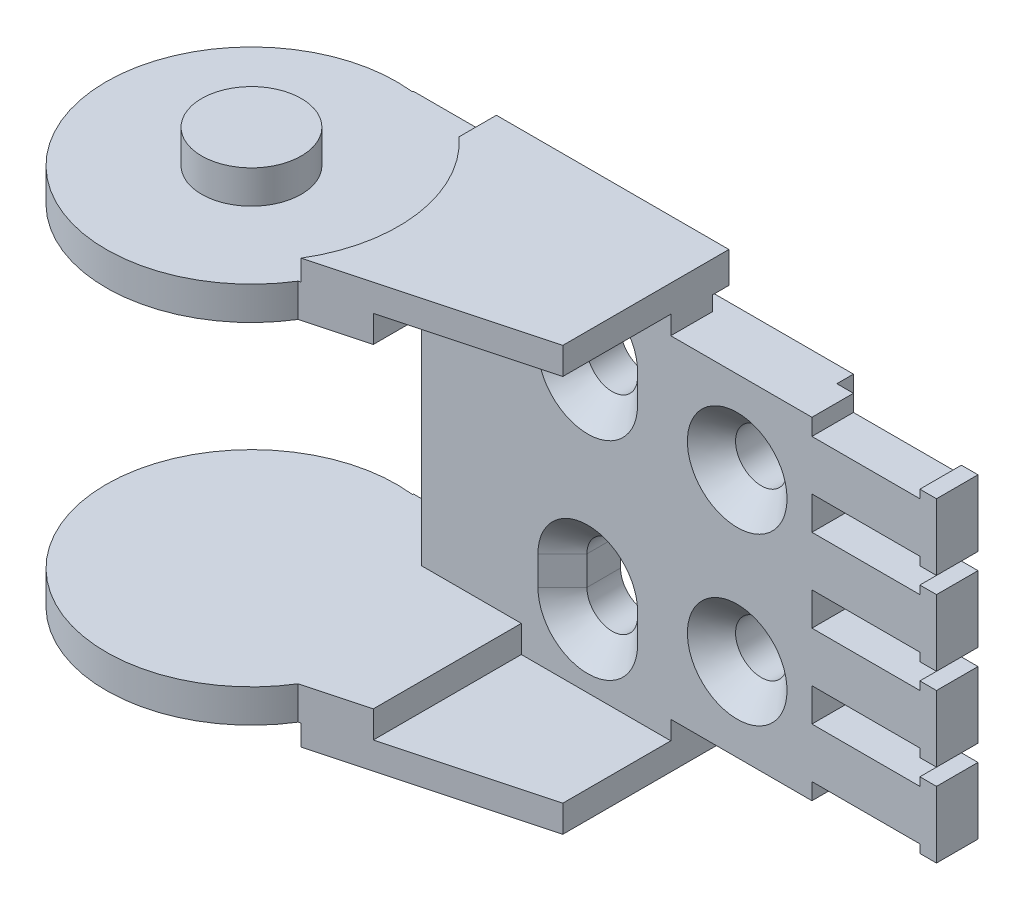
ISO-10303-21;
HEADER;
FILE_DESCRIPTION(('STEP AP214'),'2;1');
FILE_NAME('part.step','',(''),(''),'','','');
FILE_SCHEMA(('AUTOMOTIVE_DESIGN { 1 0 10303 214 1 1 1 1 }'));
ENDSEC;
DATA;
#1=APPLICATION_CONTEXT('core data for automotive mechanical design processes');
#2=APPLICATION_PROTOCOL_DEFINITION('international standard','automotive_design',2000,#1);
#3=PRODUCT_CONTEXT('',#1,'mechanical');
#4=PRODUCT('Part','Part','',(#3));
#5=PRODUCT_RELATED_PRODUCT_CATEGORY('part','',(#4));
#6=PRODUCT_DEFINITION_FORMATION('','',#4);
#7=PRODUCT_DEFINITION_CONTEXT('part definition',#1,'design');
#8=PRODUCT_DEFINITION('design','',#6,#7);
#9=PRODUCT_DEFINITION_SHAPE('','',#8);
#10=(LENGTH_UNIT() NAMED_UNIT(*) SI_UNIT(.MILLI.,.METRE.));
#11=(NAMED_UNIT(*) PLANE_ANGLE_UNIT() SI_UNIT($,.RADIAN.));
#12=(NAMED_UNIT(*) SI_UNIT($,.STERADIAN.) SOLID_ANGLE_UNIT());
#13=UNCERTAINTY_MEASURE_WITH_UNIT(LENGTH_MEASURE(1.E-05),#10,'distance_accuracy_value','');
#14=(GEOMETRIC_REPRESENTATION_CONTEXT(3) GLOBAL_UNCERTAINTY_ASSIGNED_CONTEXT((#13)) GLOBAL_UNIT_ASSIGNED_CONTEXT((#10,
#11,#12)) REPRESENTATION_CONTEXT('',''));
#15=CARTESIAN_POINT('',(0.,0.,0.));
#16=DIRECTION('',(0.,0.,1.));
#17=DIRECTION('',(1.,0.,0.));
#18=AXIS2_PLACEMENT_3D('',#15,#16,#17);
#19=CARTESIAN_POINT('',(70.,39.,-13.));
#20=DIRECTION('',(-1.,0.,0.));
#21=DIRECTION('',(0.,0.,1.));
#22=AXIS2_PLACEMENT_3D('',#19,#20,#21);
#23=PLANE('',#22);
#24=DIRECTION('',(0.,0.,1.));
#25=VECTOR('',#24,1.);
#26=CARTESIAN_POINT('',(70.,37.,-13.));
#27=LINE('',#26,#25);
#28=CARTESIAN_POINT('',(70.,37.,-10.5));
#29=VERTEX_POINT('',#28);
#30=CARTESIAN_POINT('',(70.,37.,-15.5));
#31=VERTEX_POINT('',#30);
#32=EDGE_CURVE('E607',#29,#31,#27,.F.);
#33=ORIENTED_EDGE('',*,*,#32,.F.);
#34=DIRECTION('',(0.,1.,0.));
#35=VECTOR('',#34,1.);
#36=CARTESIAN_POINT('',(70.,39.,-10.5));
#37=LINE('',#36,#35);
#38=CARTESIAN_POINT('',(70.,38.,-10.5));
#39=VERTEX_POINT('',#38);
#40=EDGE_CURVE('E673',#29,#39,#37,.T.);
#41=ORIENTED_EDGE('',*,*,#40,.T.);
#42=DIRECTION('',(0.,0.,1.));
#43=VECTOR('',#42,1.);
#44=CARTESIAN_POINT('',(70.,38.,-13.));
#45=LINE('',#44,#43);
#46=CARTESIAN_POINT('',(70.,38.,-15.5));
#47=VERTEX_POINT('',#46);
#48=EDGE_CURVE('E611',#47,#39,#45,.T.);
#49=ORIENTED_EDGE('',*,*,#48,.F.);
#50=DIRECTION('',(0.,1.,0.));
#51=VECTOR('',#50,1.);
#52=CARTESIAN_POINT('',(70.,39.,-15.5));
#53=LINE('',#52,#51);
#54=EDGE_CURVE('E677',#47,#31,#53,.F.);
#55=ORIENTED_EDGE('',*,*,#54,.T.);
#56=EDGE_LOOP('',(#33,#41,#49,#55));
#57=FACE_BOUND('',#56,.T.);
#58=ADVANCED_FACE('F16',(#57),#23,.T.);
#59=CARTESIAN_POINT('',(70.,-1.,-13.));
#60=DIRECTION('',(-1.,0.,0.));
#61=DIRECTION('',(0.,0.,1.));
#62=AXIS2_PLACEMENT_3D('',#59,#60,#61);
#63=PLANE('',#62);
#64=DIRECTION('',(0.,0.,-1.));
#65=VECTOR('',#64,1.);
#66=CARTESIAN_POINT('',(70.,1.,-13.));
#67=LINE('',#66,#65);
#68=CARTESIAN_POINT('',(70.,1.,-15.5));
#69=VERTEX_POINT('',#68);
#70=CARTESIAN_POINT('',(70.,1.,-10.5));
#71=VERTEX_POINT('',#70);
#72=EDGE_CURVE('E610',#69,#71,#67,.F.);
#73=ORIENTED_EDGE('',*,*,#72,.F.);
#74=DIRECTION('',(0.,1.,0.));
#75=VECTOR('',#74,1.);
#76=CARTESIAN_POINT('',(70.,-1.,-15.5));
#77=LINE('',#76,#75);
#78=CARTESIAN_POINT('',(70.,0.,-15.5));
#79=VERTEX_POINT('',#78);
#80=EDGE_CURVE('E667',#69,#79,#77,.F.);
#81=ORIENTED_EDGE('',*,*,#80,.T.);
#82=DIRECTION('',(0.,0.,-1.));
#83=VECTOR('',#82,1.);
#84=CARTESIAN_POINT('',(70.,0.,-13.));
#85=LINE('',#84,#83);
#86=CARTESIAN_POINT('',(70.,0.,-10.5));
#87=VERTEX_POINT('',#86);
#88=EDGE_CURVE('E641',#87,#79,#85,.T.);
#89=ORIENTED_EDGE('',*,*,#88,.F.);
#90=DIRECTION('',(0.,1.,0.));
#91=VECTOR('',#90,1.);
#92=CARTESIAN_POINT('',(70.,-1.,-10.5));
#93=LINE('',#92,#91);
#94=EDGE_CURVE('E669',#87,#71,#93,.T.);
#95=ORIENTED_EDGE('',*,*,#94,.T.);
#96=EDGE_LOOP('',(#73,#81,#89,#95));
#97=FACE_BOUND('',#96,.T.);
#98=ADVANCED_FACE('F1469',(#97),#63,.T.);
#99=CARTESIAN_POINT('',(70.,9.,-13.));
#100=DIRECTION('',(-1.,0.,0.));
#101=DIRECTION('',(0.,0.,1.));
#102=AXIS2_PLACEMENT_3D('',#99,#100,#101);
#103=PLANE('',#102);
#104=DIRECTION('',(0.,0.,1.));
#105=VECTOR('',#104,1.);
#106=CARTESIAN_POINT('',(70.,7.,-13.));
#107=LINE('',#106,#105);
#108=CARTESIAN_POINT('',(70.,7.,-10.5));
#109=VERTEX_POINT('',#108);
#110=CARTESIAN_POINT('',(70.,7.,-15.5));
#111=VERTEX_POINT('',#110);
#112=EDGE_CURVE('E1215',#109,#111,#107,.F.);
#113=ORIENTED_EDGE('',*,*,#112,.F.);
#114=DIRECTION('',(0.,1.,0.));
#115=VECTOR('',#114,1.);
#116=CARTESIAN_POINT('',(70.,9.,-10.5));
#117=LINE('',#116,#115);
#118=CARTESIAN_POINT('',(70.,8.,-10.5));
#119=VERTEX_POINT('',#118);
#120=EDGE_CURVE('E663',#109,#119,#117,.T.);
#121=ORIENTED_EDGE('',*,*,#120,.T.);
#122=DIRECTION('',(0.,0.,1.));
#123=VECTOR('',#122,1.);
#124=CARTESIAN_POINT('',(70.,8.,-13.));
#125=LINE('',#124,#123);
#126=CARTESIAN_POINT('',(70.,8.,-15.5));
#127=VERTEX_POINT('',#126);
#128=EDGE_CURVE('E1218',#127,#119,#125,.T.);
#129=ORIENTED_EDGE('',*,*,#128,.F.);
#130=DIRECTION('',(0.,1.,0.));
#131=VECTOR('',#130,1.);
#132=CARTESIAN_POINT('',(70.,9.,-15.5));
#133=LINE('',#132,#131);
#134=EDGE_CURVE('E665',#127,#111,#133,.F.);
#135=ORIENTED_EDGE('',*,*,#134,.T.);
#136=EDGE_LOOP('',(#113,#121,#129,#135));
#137=FACE_BOUND('',#136,.T.);
#138=ADVANCED_FACE('F1484',(#137),#103,.T.);
#139=CARTESIAN_POINT('',(70.,9.,-13.));
#140=DIRECTION('',(-1.,0.,0.));
#141=DIRECTION('',(0.,0.,1.));
#142=AXIS2_PLACEMENT_3D('',#139,#140,#141);
#143=PLANE('',#142);
#144=DIRECTION('',(0.,0.,-1.));
#145=VECTOR('',#144,1.);
#146=CARTESIAN_POINT('',(70.,11.,-13.));
#147=LINE('',#146,#145);
#148=CARTESIAN_POINT('',(70.,11.,-15.5));
#149=VERTEX_POINT('',#148);
#150=CARTESIAN_POINT('',(70.,11.,-10.5));
#151=VERTEX_POINT('',#150);
#152=EDGE_CURVE('E1208',#149,#151,#147,.F.);
#153=ORIENTED_EDGE('',*,*,#152,.F.);
#154=DIRECTION('',(0.,1.,0.));
#155=VECTOR('',#154,1.);
#156=CARTESIAN_POINT('',(70.,9.,-15.5));
#157=LINE('',#156,#155);
#158=CARTESIAN_POINT('',(70.,10.,-15.5));
#159=VERTEX_POINT('',#158);
#160=EDGE_CURVE('E659',#149,#159,#157,.F.);
#161=ORIENTED_EDGE('',*,*,#160,.T.);
#162=DIRECTION('',(0.,0.,-1.));
#163=VECTOR('',#162,1.);
#164=CARTESIAN_POINT('',(70.,10.,-13.));
#165=LINE('',#164,#163);
#166=CARTESIAN_POINT('',(70.,10.,-10.5));
#167=VERTEX_POINT('',#166);
#168=EDGE_CURVE('E1205',#167,#159,#165,.T.);
#169=ORIENTED_EDGE('',*,*,#168,.F.);
#170=DIRECTION('',(0.,1.,0.));
#171=VECTOR('',#170,1.);
#172=CARTESIAN_POINT('',(70.,9.,-10.5));
#173=LINE('',#172,#171);
#174=EDGE_CURVE('E661',#167,#151,#173,.T.);
#175=ORIENTED_EDGE('',*,*,#174,.T.);
#176=EDGE_LOOP('',(#153,#161,#169,#175));
#177=FACE_BOUND('',#176,.T.);
#178=ADVANCED_FACE('F1499',(#177),#143,.T.);
#179=CARTESIAN_POINT('',(70.,19.,-13.));
#180=DIRECTION('',(-1.,0.,0.));
#181=DIRECTION('',(0.,0.,1.));
#182=AXIS2_PLACEMENT_3D('',#179,#180,#181);
#183=PLANE('',#182);
#184=DIRECTION('',(0.,0.,1.));
#185=VECTOR('',#184,1.);
#186=CARTESIAN_POINT('',(70.,17.,-13.));
#187=LINE('',#186,#185);
#188=CARTESIAN_POINT('',(70.,17.,-10.5));
#189=VERTEX_POINT('',#188);
#190=CARTESIAN_POINT('',(70.,17.,-15.5));
#191=VERTEX_POINT('',#190);
#192=EDGE_CURVE('E1195',#189,#191,#187,.F.);
#193=ORIENTED_EDGE('',*,*,#192,.F.);
#194=DIRECTION('',(0.,1.,0.));
#195=VECTOR('',#194,1.);
#196=CARTESIAN_POINT('',(70.,19.,-10.5));
#197=LINE('',#196,#195);
#198=CARTESIAN_POINT('',(70.,18.,-10.5));
#199=VERTEX_POINT('',#198);
#200=EDGE_CURVE('E655',#189,#199,#197,.T.);
#201=ORIENTED_EDGE('',*,*,#200,.T.);
#202=DIRECTION('',(0.,0.,1.));
#203=VECTOR('',#202,1.);
#204=CARTESIAN_POINT('',(70.,18.,-13.));
#205=LINE('',#204,#203);
#206=CARTESIAN_POINT('',(70.,18.,-15.5));
#207=VERTEX_POINT('',#206);
#208=EDGE_CURVE('E1198',#207,#199,#205,.T.);
#209=ORIENTED_EDGE('',*,*,#208,.F.);
#210=DIRECTION('',(0.,1.,0.));
#211=VECTOR('',#210,1.);
#212=CARTESIAN_POINT('',(70.,19.,-15.5));
#213=LINE('',#212,#211);
#214=EDGE_CURVE('E657',#207,#191,#213,.F.);
#215=ORIENTED_EDGE('',*,*,#214,.T.);
#216=EDGE_LOOP('',(#193,#201,#209,#215));
#217=FACE_BOUND('',#216,.T.);
#218=ADVANCED_FACE('F1517',(#217),#183,.T.);
#219=CARTESIAN_POINT('',(70.,19.,-13.));
#220=DIRECTION('',(-1.,0.,0.));
#221=DIRECTION('',(0.,0.,1.));
#222=AXIS2_PLACEMENT_3D('',#219,#220,#221);
#223=PLANE('',#222);
#224=DIRECTION('',(0.,0.,-1.));
#225=VECTOR('',#224,1.);
#226=CARTESIAN_POINT('',(70.,21.,-13.));
#227=LINE('',#226,#225);
#228=CARTESIAN_POINT('',(70.,21.,-15.5));
#229=VERTEX_POINT('',#228);
#230=CARTESIAN_POINT('',(70.,21.,-10.5));
#231=VERTEX_POINT('',#230);
#232=EDGE_CURVE('E1188',#229,#231,#227,.F.);
#233=ORIENTED_EDGE('',*,*,#232,.F.);
#234=DIRECTION('',(0.,1.,0.));
#235=VECTOR('',#234,1.);
#236=CARTESIAN_POINT('',(70.,19.,-15.5));
#237=LINE('',#236,#235);
#238=CARTESIAN_POINT('',(70.,20.,-15.5));
#239=VERTEX_POINT('',#238);
#240=EDGE_CURVE('E651',#229,#239,#237,.F.);
#241=ORIENTED_EDGE('',*,*,#240,.T.);
#242=DIRECTION('',(0.,0.,-1.));
#243=VECTOR('',#242,1.);
#244=CARTESIAN_POINT('',(70.,20.,-13.));
#245=LINE('',#244,#243);
#246=CARTESIAN_POINT('',(70.,20.,-10.5));
#247=VERTEX_POINT('',#246);
#248=EDGE_CURVE('E1185',#247,#239,#245,.T.);
#249=ORIENTED_EDGE('',*,*,#248,.F.);
#250=DIRECTION('',(0.,1.,0.));
#251=VECTOR('',#250,1.);
#252=CARTESIAN_POINT('',(70.,19.,-10.5));
#253=LINE('',#252,#251);
#254=EDGE_CURVE('E653',#247,#231,#253,.T.);
#255=ORIENTED_EDGE('',*,*,#254,.T.);
#256=EDGE_LOOP('',(#233,#241,#249,#255));
#257=FACE_BOUND('',#256,.T.);
#258=ADVANCED_FACE('F1532',(#257),#223,.T.);
#259=CARTESIAN_POINT('',(70.,29.,-13.));
#260=DIRECTION('',(-1.,0.,0.));
#261=DIRECTION('',(0.,0.,1.));
#262=AXIS2_PLACEMENT_3D('',#259,#260,#261);
#263=PLANE('',#262);
#264=DIRECTION('',(0.,0.,1.));
#265=VECTOR('',#264,1.);
#266=CARTESIAN_POINT('',(70.,27.,-13.));
#267=LINE('',#266,#265);
#268=CARTESIAN_POINT('',(70.,27.,-10.5));
#269=VERTEX_POINT('',#268);
#270=CARTESIAN_POINT('',(70.,27.,-15.5));
#271=VERTEX_POINT('',#270);
#272=EDGE_CURVE('E1175',#269,#271,#267,.F.);
#273=ORIENTED_EDGE('',*,*,#272,.F.);
#274=DIRECTION('',(0.,1.,0.));
#275=VECTOR('',#274,1.);
#276=CARTESIAN_POINT('',(70.,29.,-10.5));
#277=LINE('',#276,#275);
#278=CARTESIAN_POINT('',(70.,28.,-10.5));
#279=VERTEX_POINT('',#278);
#280=EDGE_CURVE('E647',#269,#279,#277,.T.);
#281=ORIENTED_EDGE('',*,*,#280,.T.);
#282=DIRECTION('',(0.,0.,1.));
#283=VECTOR('',#282,1.);
#284=CARTESIAN_POINT('',(70.,28.,-13.));
#285=LINE('',#284,#283);
#286=CARTESIAN_POINT('',(70.,28.,-15.5));
#287=VERTEX_POINT('',#286);
#288=EDGE_CURVE('E1178',#287,#279,#285,.T.);
#289=ORIENTED_EDGE('',*,*,#288,.F.);
#290=DIRECTION('',(0.,1.,0.));
#291=VECTOR('',#290,1.);
#292=CARTESIAN_POINT('',(70.,29.,-15.5));
#293=LINE('',#292,#291);
#294=EDGE_CURVE('E649',#287,#271,#293,.F.);
#295=ORIENTED_EDGE('',*,*,#294,.T.);
#296=EDGE_LOOP('',(#273,#281,#289,#295));
#297=FACE_BOUND('',#296,.T.);
#298=ADVANCED_FACE('F1548',(#297),#263,.T.);
#299=CARTESIAN_POINT('',(70.,29.,-13.));
#300=DIRECTION('',(-1.,0.,0.));
#301=DIRECTION('',(0.,0.,1.));
#302=AXIS2_PLACEMENT_3D('',#299,#300,#301);
#303=PLANE('',#302);
#304=DIRECTION('',(0.,0.,-1.));
#305=VECTOR('',#304,1.);
#306=CARTESIAN_POINT('',(70.,31.,-13.));
#307=LINE('',#306,#305);
#308=CARTESIAN_POINT('',(70.,31.,-15.5));
#309=VERTEX_POINT('',#308);
#310=CARTESIAN_POINT('',(70.,31.,-10.5));
#311=VERTEX_POINT('',#310);
#312=EDGE_CURVE('E1168',#309,#311,#307,.F.);
#313=ORIENTED_EDGE('',*,*,#312,.F.);
#314=DIRECTION('',(0.,1.,0.));
#315=VECTOR('',#314,1.);
#316=CARTESIAN_POINT('',(70.,29.,-15.5));
#317=LINE('',#316,#315);
#318=CARTESIAN_POINT('',(70.,30.,-15.5));
#319=VERTEX_POINT('',#318);
#320=EDGE_CURVE('E614',#309,#319,#317,.F.);
#321=ORIENTED_EDGE('',*,*,#320,.T.);
#322=DIRECTION('',(0.,0.,-1.));
#323=VECTOR('',#322,1.);
#324=CARTESIAN_POINT('',(70.,30.,-13.));
#325=LINE('',#324,#323);
#326=CARTESIAN_POINT('',(70.,30.,-10.5));
#327=VERTEX_POINT('',#326);
#328=EDGE_CURVE('E1165',#327,#319,#325,.T.);
#329=ORIENTED_EDGE('',*,*,#328,.F.);
#330=DIRECTION('',(0.,1.,0.));
#331=VECTOR('',#330,1.);
#332=CARTESIAN_POINT('',(70.,29.,-10.5));
#333=LINE('',#332,#331);
#334=EDGE_CURVE('E645',#327,#311,#333,.T.);
#335=ORIENTED_EDGE('',*,*,#334,.T.);
#336=EDGE_LOOP('',(#313,#321,#329,#335));
#337=FACE_BOUND('',#336,.T.);
#338=ADVANCED_FACE('F1565',(#337),#303,.T.);
#339=CARTESIAN_POINT('',(0.,-8.,0.));
#340=DIRECTION('',(0.,-1.,0.));
#341=DIRECTION('',(0.,0.,-1.));
#342=AXIS2_PLACEMENT_3D('',#339,#340,#341);
#343=PLANE('',#342);
#344=CARTESIAN_POINT('',(0.,-8.,0.));
#345=DIRECTION('',(0.,1.,0.));
#346=DIRECTION('',(0.,0.,1.));
#347=AXIS2_PLACEMENT_3D('',#344,#345,#346);
#348=CIRCLE('',#347,6.);
#349=CARTESIAN_POINT('',(0.,-8.,6.));
#350=VERTEX_POINT('',#349);
#351=EDGE_CURVE('E19',#350,#350,#348,.T.);
#352=ORIENTED_EDGE('',*,*,#351,.F.);
#353=EDGE_LOOP('',(#352));
#354=FACE_BOUND('',#353,.T.);
#355=ADVANCED_FACE('F1924',(#354),#343,.T.);
#356=CARTESIAN_POINT('',(0.,46.,0.));
#357=DIRECTION('',(0.,1.,0.));
#358=DIRECTION('',(0.,0.,1.));
#359=AXIS2_PLACEMENT_3D('',#356,#357,#358);
#360=PLANE('',#359);
#361=CARTESIAN_POINT('',(0.,46.,0.));
#362=DIRECTION('',(0.,1.,0.));
#363=DIRECTION('',(0.,0.,1.));
#364=AXIS2_PLACEMENT_3D('',#361,#362,#363);
#365=CIRCLE('',#364,6.);
#366=CARTESIAN_POINT('',(0.,46.,6.));
#367=VERTEX_POINT('',#366);
#368=EDGE_CURVE('E554',#367,#367,#365,.F.);
#369=ORIENTED_EDGE('',*,*,#368,.F.);
#370=EDGE_LOOP('',(#369));
#371=FACE_BOUND('',#370,.T.);
#372=ADVANCED_FACE('F1921',(#371),#360,.T.);
#373=CARTESIAN_POINT('',(71.,38.,-13.));
#374=DIRECTION('',(0.,1.,0.));
#375=DIRECTION('',(0.,0.,1.));
#376=AXIS2_PLACEMENT_3D('',#373,#374,#375);
#377=PLANE('',#376);
#378=ORIENTED_EDGE('',*,*,#48,.T.);
#379=DIRECTION('',(1.,0.,0.));
#380=VECTOR('',#379,1.);
#381=CARTESIAN_POINT('',(72.,38.,-10.5));
#382=LINE('',#381,#380);
#383=CARTESIAN_POINT('',(72.,38.,-10.5));
#384=VERTEX_POINT('',#383);
#385=EDGE_CURVE('E767',#384,#39,#382,.F.);
#386=ORIENTED_EDGE('',*,*,#385,.F.);
#387=DIRECTION('',(0.,0.,-1.));
#388=VECTOR('',#387,1.);
#389=CARTESIAN_POINT('',(72.,38.,-15.5));
#390=LINE('',#389,#388);
#391=CARTESIAN_POINT('',(72.,38.,-15.5));
#392=VERTEX_POINT('',#391);
#393=EDGE_CURVE('E1162',#392,#384,#390,.F.);
#394=ORIENTED_EDGE('',*,*,#393,.F.);
#395=DIRECTION('',(-1.,0.,0.));
#396=VECTOR('',#395,1.);
#397=CARTESIAN_POINT('',(55.,38.,-15.5));
#398=LINE('',#397,#396);
#399=EDGE_CURVE('E1059',#47,#392,#398,.F.);
#400=ORIENTED_EDGE('',*,*,#399,.F.);
#401=EDGE_LOOP('',(#378,#386,#394,#400));
#402=FACE_BOUND('',#401,.T.);
#403=ADVANCED_FACE('F1369',(#402),#377,.T.);
#404=CARTESIAN_POINT('',(63.5,37.,-13.));
#405=DIRECTION('',(0.,1.,0.));
#406=DIRECTION('',(0.,0.,1.));
#407=AXIS2_PLACEMENT_3D('',#404,#405,#406);
#408=PLANE('',#407);
#409=DIRECTION('',(0.,0.,-1.));
#410=VECTOR('',#409,1.);
#411=CARTESIAN_POINT('',(57.,37.,-13.));
#412=LINE('',#411,#410);
#413=CARTESIAN_POINT('',(57.,37.,-10.5));
#414=VERTEX_POINT('',#413);
#415=CARTESIAN_POINT('',(57.,37.,-15.5));
#416=VERTEX_POINT('',#415);
#417=EDGE_CURVE('E1062',#414,#416,#412,.T.);
#418=ORIENTED_EDGE('',*,*,#417,.F.);
#419=DIRECTION('',(1.,0.,0.));
#420=VECTOR('',#419,1.);
#421=CARTESIAN_POINT('',(72.,37.,-10.5));
#422=LINE('',#421,#420);
#423=EDGE_CURVE('E1363',#29,#414,#422,.F.);
#424=ORIENTED_EDGE('',*,*,#423,.F.);
#425=ORIENTED_EDGE('',*,*,#32,.T.);
#426=DIRECTION('',(-1.,0.,0.));
#427=VECTOR('',#426,1.);
#428=CARTESIAN_POINT('',(55.,37.,-15.5));
#429=LINE('',#428,#427);
#430=EDGE_CURVE('E624',#416,#31,#429,.F.);
#431=ORIENTED_EDGE('',*,*,#430,.F.);
#432=EDGE_LOOP('',(#418,#424,#425,#431));
#433=FACE_BOUND('',#432,.T.);
#434=ADVANCED_FACE('F1382',(#433),#408,.T.);
#435=CARTESIAN_POINT('',(63.5,1.,-13.));
#436=DIRECTION('',(0.,-1.,0.));
#437=DIRECTION('',(0.,0.,-1.));
#438=AXIS2_PLACEMENT_3D('',#435,#436,#437);
#439=PLANE('',#438);
#440=ORIENTED_EDGE('',*,*,#72,.T.);
#441=DIRECTION('',(1.,0.,0.));
#442=VECTOR('',#441,1.);
#443=CARTESIAN_POINT('',(72.,1.,-10.5));
#444=LINE('',#443,#442);
#445=CARTESIAN_POINT('',(57.,1.,-10.5));
#446=VERTEX_POINT('',#445);
#447=EDGE_CURVE('E693',#446,#71,#444,.T.);
#448=ORIENTED_EDGE('',*,*,#447,.F.);
#449=DIRECTION('',(0.,0.,-1.));
#450=VECTOR('',#449,1.);
#451=CARTESIAN_POINT('',(57.,1.,-13.));
#452=LINE('',#451,#450);
#453=CARTESIAN_POINT('',(57.,1.,-15.5));
#454=VERTEX_POINT('',#453);
#455=EDGE_CURVE('E623',#454,#446,#452,.F.);
#456=ORIENTED_EDGE('',*,*,#455,.F.);
#457=DIRECTION('',(-1.,0.,0.));
#458=VECTOR('',#457,1.);
#459=CARTESIAN_POINT('',(55.,1.,-15.5));
#460=LINE('',#459,#458);
#461=EDGE_CURVE('E627',#69,#454,#460,.T.);
#462=ORIENTED_EDGE('',*,*,#461,.F.);
#463=EDGE_LOOP('',(#440,#448,#456,#462));
#464=FACE_BOUND('',#463,.T.);
#465=ADVANCED_FACE('F1464',(#464),#439,.T.);
#466=CARTESIAN_POINT('',(71.,0.,-13.));
#467=DIRECTION('',(0.,-1.,0.));
#468=DIRECTION('',(0.,0.,-1.));
#469=AXIS2_PLACEMENT_3D('',#466,#467,#468);
#470=PLANE('',#469);
#471=DIRECTION('',(0.,0.,-1.));
#472=VECTOR('',#471,1.);
#473=CARTESIAN_POINT('',(72.,0.,-15.5));
#474=LINE('',#473,#472);
#475=CARTESIAN_POINT('',(72.,0.,-10.5));
#476=VERTEX_POINT('',#475);
#477=CARTESIAN_POINT('',(72.,0.,-15.5));
#478=VERTEX_POINT('',#477);
#479=EDGE_CURVE('E681',#476,#478,#474,.T.);
#480=ORIENTED_EDGE('',*,*,#479,.F.);
#481=DIRECTION('',(1.,0.,0.));
#482=VECTOR('',#481,1.);
#483=CARTESIAN_POINT('',(72.,0.,-10.5));
#484=LINE('',#483,#482);
#485=EDGE_CURVE('E689',#87,#476,#484,.T.);
#486=ORIENTED_EDGE('',*,*,#485,.F.);
#487=ORIENTED_EDGE('',*,*,#88,.T.);
#488=DIRECTION('',(-1.,0.,0.));
#489=VECTOR('',#488,1.);
#490=CARTESIAN_POINT('',(55.,0.,-15.5));
#491=LINE('',#490,#489);
#492=EDGE_CURVE('E630',#478,#79,#491,.T.);
#493=ORIENTED_EDGE('',*,*,#492,.F.);
#494=EDGE_LOOP('',(#480,#486,#487,#493));
#495=FACE_BOUND('',#494,.T.);
#496=ADVANCED_FACE('F1472',(#495),#470,.T.);
#497=CARTESIAN_POINT('',(72.,-1.,-15.5));
#498=DIRECTION('',(1.,0.,0.));
#499=DIRECTION('',(0.,0.,-1.));
#500=AXIS2_PLACEMENT_3D('',#497,#498,#499);
#501=PLANE('',#500);
#502=ORIENTED_EDGE('',*,*,#479,.T.);
#503=DIRECTION('',(0.,1.,0.));
#504=VECTOR('',#503,1.);
#505=CARTESIAN_POINT('',(72.,-1.,-15.5));
#506=LINE('',#505,#504);
#507=CARTESIAN_POINT('',(72.,8.,-15.5));
#508=VERTEX_POINT('',#507);
#509=EDGE_CURVE('E686',#508,#478,#506,.F.);
#510=ORIENTED_EDGE('',*,*,#509,.F.);
#511=DIRECTION('',(0.,0.,1.));
#512=VECTOR('',#511,1.);
#513=CARTESIAN_POINT('',(72.,8.,-13.));
#514=LINE('',#513,#512);
#515=CARTESIAN_POINT('',(72.,8.,-10.5));
#516=VERTEX_POINT('',#515);
#517=EDGE_CURVE('E1221',#516,#508,#514,.F.);
#518=ORIENTED_EDGE('',*,*,#517,.F.);
#519=DIRECTION('',(0.,1.,0.));
#520=VECTOR('',#519,1.);
#521=CARTESIAN_POINT('',(72.,-1.,-10.5));
#522=LINE('',#521,#520);
#523=EDGE_CURVE('E692',#476,#516,#522,.T.);
#524=ORIENTED_EDGE('',*,*,#523,.F.);
#525=EDGE_LOOP('',(#502,#510,#518,#524));
#526=FACE_BOUND('',#525,.T.);
#527=ADVANCED_FACE('F1476',(#526),#501,.T.);
#528=CARTESIAN_POINT('',(71.,8.,-13.));
#529=DIRECTION('',(0.,1.,0.));
#530=DIRECTION('',(0.,0.,1.));
#531=AXIS2_PLACEMENT_3D('',#528,#529,#530);
#532=PLANE('',#531);
#533=ORIENTED_EDGE('',*,*,#128,.T.);
#534=DIRECTION('',(1.,0.,0.));
#535=VECTOR('',#534,1.);
#536=CARTESIAN_POINT('',(72.,8.,-10.5));
#537=LINE('',#536,#535);
#538=EDGE_CURVE('E1356',#516,#119,#537,.F.);
#539=ORIENTED_EDGE('',*,*,#538,.F.);
#540=ORIENTED_EDGE('',*,*,#517,.T.);
#541=DIRECTION('',(-1.,0.,0.));
#542=VECTOR('',#541,1.);
#543=CARTESIAN_POINT('',(55.,8.,-15.5));
#544=LINE('',#543,#542);
#545=EDGE_CURVE('E1005',#127,#508,#544,.F.);
#546=ORIENTED_EDGE('',*,*,#545,.F.);
#547=EDGE_LOOP('',(#533,#539,#540,#546));
#548=FACE_BOUND('',#547,.T.);
#549=ADVANCED_FACE('F1480',(#548),#532,.T.);
#550=CARTESIAN_POINT('',(63.5,7.,-13.));
#551=DIRECTION('',(0.,1.,0.));
#552=DIRECTION('',(0.,0.,1.));
#553=AXIS2_PLACEMENT_3D('',#550,#551,#552);
#554=PLANE('',#553);
#555=DIRECTION('',(0.,0.,-1.));
#556=VECTOR('',#555,1.);
#557=CARTESIAN_POINT('',(57.,7.,-13.));
#558=LINE('',#557,#556);
#559=CARTESIAN_POINT('',(57.,7.,-10.5));
#560=VERTEX_POINT('',#559);
#561=CARTESIAN_POINT('',(57.,7.,-15.5));
#562=VERTEX_POINT('',#561);
#563=EDGE_CURVE('E1213',#560,#562,#558,.T.);
#564=ORIENTED_EDGE('',*,*,#563,.F.);
#565=DIRECTION('',(1.,0.,0.));
#566=VECTOR('',#565,1.);
#567=CARTESIAN_POINT('',(72.,7.,-10.5));
#568=LINE('',#567,#566);
#569=EDGE_CURVE('E1353',#109,#560,#568,.F.);
#570=ORIENTED_EDGE('',*,*,#569,.F.);
#571=ORIENTED_EDGE('',*,*,#112,.T.);
#572=DIRECTION('',(-1.,0.,0.));
#573=VECTOR('',#572,1.);
#574=CARTESIAN_POINT('',(55.,7.,-15.5));
#575=LINE('',#574,#573);
#576=EDGE_CURVE('E1008',#562,#111,#575,.F.);
#577=ORIENTED_EDGE('',*,*,#576,.F.);
#578=EDGE_LOOP('',(#564,#570,#571,#577));
#579=FACE_BOUND('',#578,.T.);
#580=ADVANCED_FACE('F1488',(#579),#554,.T.);
#581=CARTESIAN_POINT('',(57.,9.,-13.));
#582=DIRECTION('',(1.,0.,0.));
#583=DIRECTION('',(0.,0.,-1.));
#584=AXIS2_PLACEMENT_3D('',#581,#582,#583);
#585=PLANE('',#584);
#586=DIRECTION('',(0.,0.,-1.));
#587=VECTOR('',#586,1.);
#588=CARTESIAN_POINT('',(57.,11.,-13.));
#589=LINE('',#588,#587);
#590=CARTESIAN_POINT('',(57.,11.,-10.5));
#591=VERTEX_POINT('',#590);
#592=CARTESIAN_POINT('',(57.,11.,-15.5));
#593=VERTEX_POINT('',#592);
#594=EDGE_CURVE('E1211',#591,#593,#589,.T.);
#595=ORIENTED_EDGE('',*,*,#594,.F.);
#596=DIRECTION('',(0.,1.,0.));
#597=VECTOR('',#596,1.);
#598=CARTESIAN_POINT('',(57.,-1.,-10.5));
#599=LINE('',#598,#597);
#600=EDGE_CURVE('E1350',#560,#591,#599,.T.);
#601=ORIENTED_EDGE('',*,*,#600,.F.);
#602=ORIENTED_EDGE('',*,*,#563,.T.);
#603=DIRECTION('',(0.,1.,0.));
#604=VECTOR('',#603,1.);
#605=CARTESIAN_POINT('',(57.,-1.,-15.5));
#606=LINE('',#605,#604);
#607=EDGE_CURVE('E1011',#593,#562,#606,.F.);
#608=ORIENTED_EDGE('',*,*,#607,.F.);
#609=EDGE_LOOP('',(#595,#601,#602,#608));
#610=FACE_BOUND('',#609,.T.);
#611=ADVANCED_FACE('F1492',(#610),#585,.T.);
#612=CARTESIAN_POINT('',(63.5,11.,-13.));
#613=DIRECTION('',(0.,-1.,0.));
#614=DIRECTION('',(0.,0.,-1.));
#615=AXIS2_PLACEMENT_3D('',#612,#613,#614);
#616=PLANE('',#615);
#617=ORIENTED_EDGE('',*,*,#152,.T.);
#618=DIRECTION('',(1.,0.,0.));
#619=VECTOR('',#618,1.);
#620=CARTESIAN_POINT('',(72.,11.,-10.5));
#621=LINE('',#620,#619);
#622=EDGE_CURVE('E1347',#591,#151,#621,.T.);
#623=ORIENTED_EDGE('',*,*,#622,.F.);
#624=ORIENTED_EDGE('',*,*,#594,.T.);
#625=DIRECTION('',(-1.,0.,0.));
#626=VECTOR('',#625,1.);
#627=CARTESIAN_POINT('',(55.,11.,-15.5));
#628=LINE('',#627,#626);
#629=EDGE_CURVE('E1014',#149,#593,#628,.T.);
#630=ORIENTED_EDGE('',*,*,#629,.F.);
#631=EDGE_LOOP('',(#617,#623,#624,#630));
#632=FACE_BOUND('',#631,.T.);
#633=ADVANCED_FACE('F1496',(#632),#616,.T.);
#634=CARTESIAN_POINT('',(71.,10.,-13.));
#635=DIRECTION('',(0.,-1.,0.));
#636=DIRECTION('',(0.,0.,-1.));
#637=AXIS2_PLACEMENT_3D('',#634,#635,#636);
#638=PLANE('',#637);
#639=DIRECTION('',(0.,0.,-1.));
#640=VECTOR('',#639,1.);
#641=CARTESIAN_POINT('',(72.,10.,-15.5));
#642=LINE('',#641,#640);
#643=CARTESIAN_POINT('',(72.,10.,-10.5));
#644=VERTEX_POINT('',#643);
#645=CARTESIAN_POINT('',(72.,10.,-15.5));
#646=VERTEX_POINT('',#645);
#647=EDGE_CURVE('E1203',#644,#646,#642,.T.);
#648=ORIENTED_EDGE('',*,*,#647,.F.);
#649=DIRECTION('',(1.,0.,0.));
#650=VECTOR('',#649,1.);
#651=CARTESIAN_POINT('',(72.,10.,-10.5));
#652=LINE('',#651,#650);
#653=EDGE_CURVE('E1344',#167,#644,#652,.T.);
#654=ORIENTED_EDGE('',*,*,#653,.F.);
#655=ORIENTED_EDGE('',*,*,#168,.T.);
#656=DIRECTION('',(-1.,0.,0.));
#657=VECTOR('',#656,1.);
#658=CARTESIAN_POINT('',(55.,10.,-15.5));
#659=LINE('',#658,#657);
#660=EDGE_CURVE('E1017',#646,#159,#659,.T.);
#661=ORIENTED_EDGE('',*,*,#660,.F.);
#662=EDGE_LOOP('',(#648,#654,#655,#661));
#663=FACE_BOUND('',#662,.T.);
#664=ADVANCED_FACE('F1504',(#663),#638,.T.);
#665=CARTESIAN_POINT('',(72.,-1.,-15.5));
#666=DIRECTION('',(1.,0.,0.));
#667=DIRECTION('',(0.,0.,-1.));
#668=AXIS2_PLACEMENT_3D('',#665,#666,#667);
#669=PLANE('',#668);
#670=ORIENTED_EDGE('',*,*,#647,.T.);
#671=DIRECTION('',(0.,1.,0.));
#672=VECTOR('',#671,1.);
#673=CARTESIAN_POINT('',(72.,-1.,-15.5));
#674=LINE('',#673,#672);
#675=CARTESIAN_POINT('',(72.,18.,-15.5));
#676=VERTEX_POINT('',#675);
#677=EDGE_CURVE('E1020',#676,#646,#674,.F.);
#678=ORIENTED_EDGE('',*,*,#677,.F.);
#679=DIRECTION('',(0.,0.,1.));
#680=VECTOR('',#679,1.);
#681=CARTESIAN_POINT('',(72.,18.,-13.));
#682=LINE('',#681,#680);
#683=CARTESIAN_POINT('',(72.,18.,-10.5));
#684=VERTEX_POINT('',#683);
#685=EDGE_CURVE('E1201',#684,#676,#682,.F.);
#686=ORIENTED_EDGE('',*,*,#685,.F.);
#687=DIRECTION('',(0.,1.,0.));
#688=VECTOR('',#687,1.);
#689=CARTESIAN_POINT('',(72.,-1.,-10.5));
#690=LINE('',#689,#688);
#691=EDGE_CURVE('E1341',#644,#684,#690,.T.);
#692=ORIENTED_EDGE('',*,*,#691,.F.);
#693=EDGE_LOOP('',(#670,#678,#686,#692));
#694=FACE_BOUND('',#693,.T.);
#695=ADVANCED_FACE('F1508',(#694),#669,.T.);
#696=CARTESIAN_POINT('',(71.,18.,-13.));
#697=DIRECTION('',(0.,1.,0.));
#698=DIRECTION('',(0.,0.,1.));
#699=AXIS2_PLACEMENT_3D('',#696,#697,#698);
#700=PLANE('',#699);
#701=ORIENTED_EDGE('',*,*,#208,.T.);
#702=DIRECTION('',(1.,0.,0.));
#703=VECTOR('',#702,1.);
#704=CARTESIAN_POINT('',(72.,18.,-10.5));
#705=LINE('',#704,#703);
#706=EDGE_CURVE('E1338',#684,#199,#705,.F.);
#707=ORIENTED_EDGE('',*,*,#706,.F.);
#708=ORIENTED_EDGE('',*,*,#685,.T.);
#709=DIRECTION('',(-1.,0.,0.));
#710=VECTOR('',#709,1.);
#711=CARTESIAN_POINT('',(55.,18.,-15.5));
#712=LINE('',#711,#710);
#713=EDGE_CURVE('E1023',#207,#676,#712,.F.);
#714=ORIENTED_EDGE('',*,*,#713,.F.);
#715=EDGE_LOOP('',(#701,#707,#708,#714));
#716=FACE_BOUND('',#715,.T.);
#717=ADVANCED_FACE('F1512',(#716),#700,.T.);
#718=CARTESIAN_POINT('',(63.5,17.,-13.));
#719=DIRECTION('',(0.,1.,0.));
#720=DIRECTION('',(0.,0.,1.));
#721=AXIS2_PLACEMENT_3D('',#718,#719,#720);
#722=PLANE('',#721);
#723=DIRECTION('',(0.,0.,-1.));
#724=VECTOR('',#723,1.);
#725=CARTESIAN_POINT('',(57.,17.,-13.));
#726=LINE('',#725,#724);
#727=CARTESIAN_POINT('',(57.,17.,-10.5));
#728=VERTEX_POINT('',#727);
#729=CARTESIAN_POINT('',(57.,17.,-15.5));
#730=VERTEX_POINT('',#729);
#731=EDGE_CURVE('E1193',#728,#730,#726,.T.);
#732=ORIENTED_EDGE('',*,*,#731,.F.);
#733=DIRECTION('',(1.,0.,0.));
#734=VECTOR('',#733,1.);
#735=CARTESIAN_POINT('',(72.,17.,-10.5));
#736=LINE('',#735,#734);
#737=EDGE_CURVE('E1335',#189,#728,#736,.F.);
#738=ORIENTED_EDGE('',*,*,#737,.F.);
#739=ORIENTED_EDGE('',*,*,#192,.T.);
#740=DIRECTION('',(-1.,0.,0.));
#741=VECTOR('',#740,1.);
#742=CARTESIAN_POINT('',(55.,17.,-15.5));
#743=LINE('',#742,#741);
#744=EDGE_CURVE('E1026',#730,#191,#743,.F.);
#745=ORIENTED_EDGE('',*,*,#744,.F.);
#746=EDGE_LOOP('',(#732,#738,#739,#745));
#747=FACE_BOUND('',#746,.T.);
#748=ADVANCED_FACE('F1520',(#747),#722,.T.);
#749=CARTESIAN_POINT('',(57.,19.,-13.));
#750=DIRECTION('',(1.,0.,0.));
#751=DIRECTION('',(0.,0.,-1.));
#752=AXIS2_PLACEMENT_3D('',#749,#750,#751);
#753=PLANE('',#752);
#754=DIRECTION('',(0.,0.,-1.));
#755=VECTOR('',#754,1.);
#756=CARTESIAN_POINT('',(57.,21.,-13.));
#757=LINE('',#756,#755);
#758=CARTESIAN_POINT('',(57.,21.,-10.5));
#759=VERTEX_POINT('',#758);
#760=CARTESIAN_POINT('',(57.,21.,-15.5));
#761=VERTEX_POINT('',#760);
#762=EDGE_CURVE('E1191',#759,#761,#757,.T.);
#763=ORIENTED_EDGE('',*,*,#762,.F.);
#764=DIRECTION('',(0.,1.,0.));
#765=VECTOR('',#764,1.);
#766=CARTESIAN_POINT('',(57.,-1.,-10.5));
#767=LINE('',#766,#765);
#768=EDGE_CURVE('E1332',#728,#759,#767,.T.);
#769=ORIENTED_EDGE('',*,*,#768,.F.);
#770=ORIENTED_EDGE('',*,*,#731,.T.);
#771=DIRECTION('',(0.,1.,0.));
#772=VECTOR('',#771,1.);
#773=CARTESIAN_POINT('',(57.,-1.,-15.5));
#774=LINE('',#773,#772);
#775=EDGE_CURVE('E1029',#761,#730,#774,.F.);
#776=ORIENTED_EDGE('',*,*,#775,.F.);
#777=EDGE_LOOP('',(#763,#769,#770,#776));
#778=FACE_BOUND('',#777,.T.);
#779=ADVANCED_FACE('F1524',(#778),#753,.T.);
#780=CARTESIAN_POINT('',(63.5,21.,-13.));
#781=DIRECTION('',(0.,-1.,0.));
#782=DIRECTION('',(0.,0.,-1.));
#783=AXIS2_PLACEMENT_3D('',#780,#781,#782);
#784=PLANE('',#783);
#785=ORIENTED_EDGE('',*,*,#232,.T.);
#786=DIRECTION('',(1.,0.,0.));
#787=VECTOR('',#786,1.);
#788=CARTESIAN_POINT('',(72.,21.,-10.5));
#789=LINE('',#788,#787);
#790=EDGE_CURVE('E1329',#759,#231,#789,.T.);
#791=ORIENTED_EDGE('',*,*,#790,.F.);
#792=ORIENTED_EDGE('',*,*,#762,.T.);
#793=DIRECTION('',(-1.,0.,0.));
#794=VECTOR('',#793,1.);
#795=CARTESIAN_POINT('',(55.,21.,-15.5));
#796=LINE('',#795,#794);
#797=EDGE_CURVE('E1032',#229,#761,#796,.T.);
#798=ORIENTED_EDGE('',*,*,#797,.F.);
#799=EDGE_LOOP('',(#785,#791,#792,#798));
#800=FACE_BOUND('',#799,.T.);
#801=ADVANCED_FACE('F1528',(#800),#784,.T.);
#802=CARTESIAN_POINT('',(71.,20.,-13.));
#803=DIRECTION('',(0.,-1.,0.));
#804=DIRECTION('',(0.,0.,-1.));
#805=AXIS2_PLACEMENT_3D('',#802,#803,#804);
#806=PLANE('',#805);
#807=DIRECTION('',(0.,0.,-1.));
#808=VECTOR('',#807,1.);
#809=CARTESIAN_POINT('',(72.,20.,-15.5));
#810=LINE('',#809,#808);
#811=CARTESIAN_POINT('',(72.,20.,-10.5));
#812=VERTEX_POINT('',#811);
#813=CARTESIAN_POINT('',(72.,20.,-15.5));
#814=VERTEX_POINT('',#813);
#815=EDGE_CURVE('E1183',#812,#814,#810,.T.);
#816=ORIENTED_EDGE('',*,*,#815,.F.);
#817=DIRECTION('',(1.,0.,0.));
#818=VECTOR('',#817,1.);
#819=CARTESIAN_POINT('',(72.,20.,-10.5));
#820=LINE('',#819,#818);
#821=EDGE_CURVE('E1326',#247,#812,#820,.T.);
#822=ORIENTED_EDGE('',*,*,#821,.F.);
#823=ORIENTED_EDGE('',*,*,#248,.T.);
#824=DIRECTION('',(-1.,0.,0.));
#825=VECTOR('',#824,1.);
#826=CARTESIAN_POINT('',(55.,20.,-15.5));
#827=LINE('',#826,#825);
#828=EDGE_CURVE('E1035',#814,#239,#827,.T.);
#829=ORIENTED_EDGE('',*,*,#828,.F.);
#830=EDGE_LOOP('',(#816,#822,#823,#829));
#831=FACE_BOUND('',#830,.T.);
#832=ADVANCED_FACE('F1536',(#831),#806,.T.);
#833=CARTESIAN_POINT('',(72.,-1.,-15.5));
#834=DIRECTION('',(1.,0.,0.));
#835=DIRECTION('',(0.,0.,-1.));
#836=AXIS2_PLACEMENT_3D('',#833,#834,#835);
#837=PLANE('',#836);
#838=ORIENTED_EDGE('',*,*,#815,.T.);
#839=DIRECTION('',(0.,1.,0.));
#840=VECTOR('',#839,1.);
#841=CARTESIAN_POINT('',(72.,-1.,-15.5));
#842=LINE('',#841,#840);
#843=CARTESIAN_POINT('',(72.,28.,-15.5));
#844=VERTEX_POINT('',#843);
#845=EDGE_CURVE('E1038',#844,#814,#842,.F.);
#846=ORIENTED_EDGE('',*,*,#845,.F.);
#847=DIRECTION('',(0.,0.,1.));
#848=VECTOR('',#847,1.);
#849=CARTESIAN_POINT('',(72.,28.,-13.));
#850=LINE('',#849,#848);
#851=CARTESIAN_POINT('',(72.,28.,-10.5));
#852=VERTEX_POINT('',#851);
#853=EDGE_CURVE('E1181',#852,#844,#850,.F.);
#854=ORIENTED_EDGE('',*,*,#853,.F.);
#855=DIRECTION('',(0.,1.,0.));
#856=VECTOR('',#855,1.);
#857=CARTESIAN_POINT('',(72.,-1.,-10.5));
#858=LINE('',#857,#856);
#859=EDGE_CURVE('E1323',#812,#852,#858,.T.);
#860=ORIENTED_EDGE('',*,*,#859,.F.);
#861=EDGE_LOOP('',(#838,#846,#854,#860));
#862=FACE_BOUND('',#861,.T.);
#863=ADVANCED_FACE('F1540',(#862),#837,.T.);
#864=CARTESIAN_POINT('',(71.,28.,-13.));
#865=DIRECTION('',(0.,1.,0.));
#866=DIRECTION('',(0.,0.,1.));
#867=AXIS2_PLACEMENT_3D('',#864,#865,#866);
#868=PLANE('',#867);
#869=ORIENTED_EDGE('',*,*,#288,.T.);
#870=DIRECTION('',(1.,0.,0.));
#871=VECTOR('',#870,1.);
#872=CARTESIAN_POINT('',(72.,28.,-10.5));
#873=LINE('',#872,#871);
#874=EDGE_CURVE('E1320',#852,#279,#873,.F.);
#875=ORIENTED_EDGE('',*,*,#874,.F.);
#876=ORIENTED_EDGE('',*,*,#853,.T.);
#877=DIRECTION('',(-1.,0.,0.));
#878=VECTOR('',#877,1.);
#879=CARTESIAN_POINT('',(55.,28.,-15.5));
#880=LINE('',#879,#878);
#881=EDGE_CURVE('E1041',#287,#844,#880,.F.);
#882=ORIENTED_EDGE('',*,*,#881,.F.);
#883=EDGE_LOOP('',(#869,#875,#876,#882));
#884=FACE_BOUND('',#883,.T.);
#885=ADVANCED_FACE('F1544',(#884),#868,.T.);
#886=CARTESIAN_POINT('',(63.5,27.,-13.));
#887=DIRECTION('',(0.,1.,0.));
#888=DIRECTION('',(0.,0.,1.));
#889=AXIS2_PLACEMENT_3D('',#886,#887,#888);
#890=PLANE('',#889);
#891=DIRECTION('',(0.,0.,-1.));
#892=VECTOR('',#891,1.);
#893=CARTESIAN_POINT('',(57.,27.,-13.));
#894=LINE('',#893,#892);
#895=CARTESIAN_POINT('',(57.,27.,-10.5));
#896=VERTEX_POINT('',#895);
#897=CARTESIAN_POINT('',(57.,27.,-15.5));
#898=VERTEX_POINT('',#897);
#899=EDGE_CURVE('E1173',#896,#898,#894,.T.);
#900=ORIENTED_EDGE('',*,*,#899,.F.);
#901=DIRECTION('',(1.,0.,0.));
#902=VECTOR('',#901,1.);
#903=CARTESIAN_POINT('',(72.,27.,-10.5));
#904=LINE('',#903,#902);
#905=EDGE_CURVE('E1317',#269,#896,#904,.F.);
#906=ORIENTED_EDGE('',*,*,#905,.F.);
#907=ORIENTED_EDGE('',*,*,#272,.T.);
#908=DIRECTION('',(-1.,0.,0.));
#909=VECTOR('',#908,1.);
#910=CARTESIAN_POINT('',(55.,27.,-15.5));
#911=LINE('',#910,#909);
#912=EDGE_CURVE('E1044',#898,#271,#911,.F.);
#913=ORIENTED_EDGE('',*,*,#912,.F.);
#914=EDGE_LOOP('',(#900,#906,#907,#913));
#915=FACE_BOUND('',#914,.T.);
#916=ADVANCED_FACE('F1552',(#915),#890,.T.);
#917=CARTESIAN_POINT('',(57.,29.,-13.));
#918=DIRECTION('',(1.,0.,0.));
#919=DIRECTION('',(0.,0.,-1.));
#920=AXIS2_PLACEMENT_3D('',#917,#918,#919);
#921=PLANE('',#920);
#922=DIRECTION('',(0.,0.,-1.));
#923=VECTOR('',#922,1.);
#924=CARTESIAN_POINT('',(57.,31.,-13.));
#925=LINE('',#924,#923);
#926=CARTESIAN_POINT('',(57.,31.,-10.5));
#927=VERTEX_POINT('',#926);
#928=CARTESIAN_POINT('',(57.,31.,-15.5));
#929=VERTEX_POINT('',#928);
#930=EDGE_CURVE('E1171',#927,#929,#925,.T.);
#931=ORIENTED_EDGE('',*,*,#930,.F.);
#932=DIRECTION('',(0.,1.,0.));
#933=VECTOR('',#932,1.);
#934=CARTESIAN_POINT('',(57.,-1.,-10.5));
#935=LINE('',#934,#933);
#936=EDGE_CURVE('E1314',#896,#927,#935,.T.);
#937=ORIENTED_EDGE('',*,*,#936,.F.);
#938=ORIENTED_EDGE('',*,*,#899,.T.);
#939=DIRECTION('',(0.,1.,0.));
#940=VECTOR('',#939,1.);
#941=CARTESIAN_POINT('',(57.,-1.,-15.5));
#942=LINE('',#941,#940);
#943=EDGE_CURVE('E1047',#929,#898,#942,.F.);
#944=ORIENTED_EDGE('',*,*,#943,.F.);
#945=EDGE_LOOP('',(#931,#937,#938,#944));
#946=FACE_BOUND('',#945,.T.);
#947=ADVANCED_FACE('F1556',(#946),#921,.T.);
#948=CARTESIAN_POINT('',(63.5,31.,-13.));
#949=DIRECTION('',(0.,-1.,0.));
#950=DIRECTION('',(0.,0.,-1.));
#951=AXIS2_PLACEMENT_3D('',#948,#949,#950);
#952=PLANE('',#951);
#953=ORIENTED_EDGE('',*,*,#312,.T.);
#954=DIRECTION('',(1.,0.,0.));
#955=VECTOR('',#954,1.);
#956=CARTESIAN_POINT('',(72.,31.,-10.5));
#957=LINE('',#956,#955);
#958=EDGE_CURVE('E1311',#927,#311,#957,.T.);
#959=ORIENTED_EDGE('',*,*,#958,.F.);
#960=ORIENTED_EDGE('',*,*,#930,.T.);
#961=DIRECTION('',(-1.,0.,0.));
#962=VECTOR('',#961,1.);
#963=CARTESIAN_POINT('',(55.,31.,-15.5));
#964=LINE('',#963,#962);
#965=EDGE_CURVE('E1050',#309,#929,#964,.T.);
#966=ORIENTED_EDGE('',*,*,#965,.F.);
#967=EDGE_LOOP('',(#953,#959,#960,#966));
#968=FACE_BOUND('',#967,.T.);
#969=ADVANCED_FACE('F1560',(#968),#952,.T.);
#970=CARTESIAN_POINT('',(71.,30.,-13.));
#971=DIRECTION('',(0.,-1.,0.));
#972=DIRECTION('',(0.,0.,-1.));
#973=AXIS2_PLACEMENT_3D('',#970,#971,#972);
#974=PLANE('',#973);
#975=DIRECTION('',(0.,0.,-1.));
#976=VECTOR('',#975,1.);
#977=CARTESIAN_POINT('',(72.,30.,-15.5));
#978=LINE('',#977,#976);
#979=CARTESIAN_POINT('',(72.,30.,-10.5));
#980=VERTEX_POINT('',#979);
#981=CARTESIAN_POINT('',(72.,30.,-15.5));
#982=VERTEX_POINT('',#981);
#983=EDGE_CURVE('E1139',#980,#982,#978,.T.);
#984=ORIENTED_EDGE('',*,*,#983,.F.);
#985=DIRECTION('',(1.,0.,0.));
#986=VECTOR('',#985,1.);
#987=CARTESIAN_POINT('',(72.,30.,-10.5));
#988=LINE('',#987,#986);
#989=EDGE_CURVE('E1309',#327,#980,#988,.T.);
#990=ORIENTED_EDGE('',*,*,#989,.F.);
#991=ORIENTED_EDGE('',*,*,#328,.T.);
#992=DIRECTION('',(-1.,0.,0.));
#993=VECTOR('',#992,1.);
#994=CARTESIAN_POINT('',(55.,30.,-15.5));
#995=LINE('',#994,#993);
#996=EDGE_CURVE('E1053',#982,#319,#995,.T.);
#997=ORIENTED_EDGE('',*,*,#996,.F.);
#998=EDGE_LOOP('',(#984,#990,#991,#997));
#999=FACE_BOUND('',#998,.T.);
#1000=ADVANCED_FACE('F1567',(#999),#974,.T.);
#1001=CARTESIAN_POINT('',(72.,-1.,-15.5));
#1002=DIRECTION('',(1.,0.,0.));
#1003=DIRECTION('',(0.,0.,-1.));
#1004=AXIS2_PLACEMENT_3D('',#1001,#1002,#1003);
#1005=PLANE('',#1004);
#1006=ORIENTED_EDGE('',*,*,#983,.T.);
#1007=DIRECTION('',(0.,1.,0.));
#1008=VECTOR('',#1007,1.);
#1009=CARTESIAN_POINT('',(72.,-1.,-15.5));
#1010=LINE('',#1009,#1008);
#1011=EDGE_CURVE('E1056',#392,#982,#1010,.F.);
#1012=ORIENTED_EDGE('',*,*,#1011,.F.);
#1013=ORIENTED_EDGE('',*,*,#393,.T.);
#1014=DIRECTION('',(0.,1.,0.));
#1015=VECTOR('',#1014,1.);
#1016=CARTESIAN_POINT('',(72.,-1.,-10.5));
#1017=LINE('',#1016,#1015);
#1018=EDGE_CURVE('E764',#980,#384,#1017,.T.);
#1019=ORIENTED_EDGE('',*,*,#1018,.F.);
#1020=EDGE_LOOP('',(#1006,#1012,#1013,#1019));
#1021=FACE_BOUND('',#1020,.T.);
#1022=ADVANCED_FACE('F1374',(#1021),#1005,.T.);
#1023=CARTESIAN_POINT('',(26.95,33.25,-13.45));
#1024=DIRECTION('',(-0.707106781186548,0.,-0.707106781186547));
#1025=DIRECTION('',(-0.707106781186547,0.,0.707106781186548));
#1026=AXIS2_PLACEMENT_3D('',#1023,#1024,#1025);
#1027=PLANE('',#1026);
#1028=DIRECTION('',(0.,1.,0.));
#1029=VECTOR('',#1028,1.);
#1030=CARTESIAN_POINT('',(26.95,33.25,-13.45));
#1031=LINE('',#1030,#1029);
#1032=CARTESIAN_POINT('',(26.9500000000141,29.75,-13.4500000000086));
#1033=VERTEX_POINT('',#1032);
#1034=CARTESIAN_POINT('',(26.9500000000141,33.25,-13.4500000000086));
#1035=VERTEX_POINT('',#1034);
#1036=EDGE_CURVE('E984',#1033,#1035,#1031,.T.);
#1037=ORIENTED_EDGE('',*,*,#1036,.T.);
#1038=DIRECTION('',(0.707106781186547,0.,-0.707106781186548));
#1039=VECTOR('',#1038,1.);
#1040=CARTESIAN_POINT('',(-498940.,33.2500000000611,498953.5));
#1041=LINE('',#1040,#1039);
#1042=CARTESIAN_POINT('',(24.0000000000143,33.25,-10.4999999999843));
#1043=VERTEX_POINT('',#1042);
#1044=EDGE_CURVE('E1102',#1035,#1043,#1041,.F.);
#1045=ORIENTED_EDGE('',*,*,#1044,.T.);
#1046=DIRECTION('',(0.,1.,0.));
#1047=VECTOR('',#1046,1.);
#1048=CARTESIAN_POINT('',(24.,-1.,-10.5));
#1049=LINE('',#1048,#1047);
#1050=CARTESIAN_POINT('',(24.0000000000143,29.75,-10.4999999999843));
#1051=VERTEX_POINT('',#1050);
#1052=EDGE_CURVE('E771',#1051,#1043,#1049,.T.);
#1053=ORIENTED_EDGE('',*,*,#1052,.F.);
#1054=DIRECTION('',(0.707106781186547,0.,-0.707106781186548));
#1055=VECTOR('',#1054,1.);
#1056=CARTESIAN_POINT('',(-498940.,29.7500000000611,498953.5));
#1057=LINE('',#1056,#1055);
#1058=EDGE_CURVE('E1135',#1051,#1033,#1057,.T.);
#1059=ORIENTED_EDGE('',*,*,#1058,.T.);
#1060=EDGE_LOOP('',(#1037,#1045,#1053,#1059));
#1061=FACE_BOUND('',#1060,.T.);
#1062=ADVANCED_FACE('F1797',(#1061),#1027,.F.);
#1063=CARTESIAN_POINT('',(30.,29.75,-10.4999999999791));
#1064=DIRECTION('',(0.,0.,1.));
#1065=DIRECTION('',(1.,0.,0.));
#1066=AXIS2_PLACEMENT_3D('',#1063,#1064,#1065);
#1067=CONICAL_SURFACE('',#1066,6.00000000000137,0.785398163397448);
#1068=CARTESIAN_POINT('',(30.,29.75,-10.4999999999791));
#1069=DIRECTION('',(0.,0.,1.));
#1070=DIRECTION('',(1.,0.,0.));
#1071=AXIS2_PLACEMENT_3D('',#1068,#1069,#1070);
#1072=CIRCLE('',#1071,6.00000000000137);
#1073=CARTESIAN_POINT('',(36.0000000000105,29.75,-10.4999999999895));
#1074=VERTEX_POINT('',#1073);
#1075=EDGE_CURVE('E765',#1074,#1051,#1072,.F.);
#1076=ORIENTED_EDGE('',*,*,#1075,.F.);
#1077=DIRECTION('',(-0.707106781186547,0.,-0.707106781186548));
#1078=VECTOR('',#1077,1.);
#1079=CARTESIAN_POINT('',(36.,29.75,-10.5));
#1080=LINE('',#1079,#1078);
#1081=CARTESIAN_POINT('',(33.05,29.75,-13.45));
#1082=VERTEX_POINT('',#1081);
#1083=EDGE_CURVE('E1127',#1074,#1082,#1080,.T.);
#1084=ORIENTED_EDGE('',*,*,#1083,.T.);
#1085=CARTESIAN_POINT('',(30.,29.75,-13.45));
#1086=DIRECTION('',(0.,0.,-1.));
#1087=DIRECTION('',(-1.,0.,0.));
#1088=AXIS2_PLACEMENT_3D('',#1085,#1086,#1087);
#1089=CIRCLE('',#1088,3.05);
#1090=EDGE_CURVE('E1106',#1082,#1033,#1089,.T.);
#1091=ORIENTED_EDGE('',*,*,#1090,.T.);
#1092=ORIENTED_EDGE('',*,*,#1058,.F.);
#1093=EDGE_LOOP('',(#1076,#1084,#1091,#1092));
#1094=FACE_BOUND('',#1093,.T.);
#1095=ADVANCED_FACE('F1794',(#1094),#1067,.F.);
#1096=CARTESIAN_POINT('',(36.,33.25,-10.5));
#1097=DIRECTION('',(0.707106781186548,0.,-0.707106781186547));
#1098=DIRECTION('',(-0.707106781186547,0.,-0.707106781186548));
#1099=AXIS2_PLACEMENT_3D('',#1096,#1097,#1098);
#1100=PLANE('',#1099);
#1101=DIRECTION('',(0.,1.,0.));
#1102=VECTOR('',#1101,1.);
#1103=CARTESIAN_POINT('',(36.,-1.,-10.5));
#1104=LINE('',#1103,#1102);
#1105=CARTESIAN_POINT('',(36.0000000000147,33.25,-10.4999999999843));
#1106=VERTEX_POINT('',#1105);
#1107=EDGE_CURVE('E768',#1106,#1074,#1104,.F.);
#1108=ORIENTED_EDGE('',*,*,#1107,.F.);
#1109=DIRECTION('',(-0.707106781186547,0.,-0.707106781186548));
#1110=VECTOR('',#1109,1.);
#1111=CARTESIAN_POINT('',(499000.,33.25,498953.5));
#1112=LINE('',#1111,#1110);
#1113=CARTESIAN_POINT('',(33.0499999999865,33.25,-13.4500000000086));
#1114=VERTEX_POINT('',#1113);
#1115=EDGE_CURVE('E1123',#1106,#1114,#1112,.T.);
#1116=ORIENTED_EDGE('',*,*,#1115,.T.);
#1117=DIRECTION('',(0.,1.,0.));
#1118=VECTOR('',#1117,1.);
#1119=CARTESIAN_POINT('',(33.05,33.25,-13.45));
#1120=LINE('',#1119,#1118);
#1121=EDGE_CURVE('E1116',#1114,#1082,#1120,.F.);
#1122=ORIENTED_EDGE('',*,*,#1121,.T.);
#1123=ORIENTED_EDGE('',*,*,#1083,.F.);
#1124=EDGE_LOOP('',(#1108,#1116,#1122,#1123));
#1125=FACE_BOUND('',#1124,.T.);
#1126=ADVANCED_FACE('F1790',(#1125),#1100,.F.);
#1127=CARTESIAN_POINT('',(30.,33.25,-10.4999999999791));
#1128=DIRECTION('',(0.,0.,1.));
#1129=DIRECTION('',(1.,0.,0.));
#1130=AXIS2_PLACEMENT_3D('',#1127,#1128,#1129);
#1131=CONICAL_SURFACE('',#1130,6.00000000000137,0.785398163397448);
#1132=CARTESIAN_POINT('',(30.,33.25,-13.45));
#1133=DIRECTION('',(0.,0.,-1.));
#1134=DIRECTION('',(-1.,0.,0.));
#1135=AXIS2_PLACEMENT_3D('',#1132,#1133,#1134);
#1136=CIRCLE('',#1135,3.05);
#1137=EDGE_CURVE('E1109',#1035,#1114,#1136,.T.);
#1138=ORIENTED_EDGE('',*,*,#1137,.T.);
#1139=ORIENTED_EDGE('',*,*,#1115,.F.);
#1140=CARTESIAN_POINT('',(30.,33.25,-10.4999999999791));
#1141=DIRECTION('',(0.,0.,1.));
#1142=DIRECTION('',(1.,0.,0.));
#1143=AXIS2_PLACEMENT_3D('',#1140,#1141,#1142);
#1144=CIRCLE('',#1143,6.00000000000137);
#1145=EDGE_CURVE('E769',#1043,#1106,#1144,.F.);
#1146=ORIENTED_EDGE('',*,*,#1145,.F.);
#1147=ORIENTED_EDGE('',*,*,#1044,.F.);
#1148=EDGE_LOOP('',(#1138,#1139,#1146,#1147));
#1149=FACE_BOUND('',#1148,.T.);
#1150=ADVANCED_FACE('F1799',(#1149),#1131,.F.);
#1151=CARTESIAN_POINT('',(26.95,8.25,-13.45));
#1152=DIRECTION('',(-0.707106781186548,0.,-0.707106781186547));
#1153=DIRECTION('',(-0.707106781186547,0.,0.707106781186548));
#1154=AXIS2_PLACEMENT_3D('',#1151,#1152,#1153);
#1155=PLANE('',#1154);
#1156=DIRECTION('',(0.,1.,0.));
#1157=VECTOR('',#1156,1.);
#1158=CARTESIAN_POINT('',(26.95,8.25,-13.45));
#1159=LINE('',#1158,#1157);
#1160=CARTESIAN_POINT('',(26.9500000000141,4.75,-13.4500000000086));
#1161=VERTEX_POINT('',#1160);
#1162=CARTESIAN_POINT('',(26.9500000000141,8.25,-13.4500000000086));
#1163=VERTEX_POINT('',#1162);
#1164=EDGE_CURVE('E1072',#1161,#1163,#1159,.T.);
#1165=ORIENTED_EDGE('',*,*,#1164,.T.);
#1166=DIRECTION('',(0.707106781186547,0.,-0.707106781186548));
#1167=VECTOR('',#1166,1.);
#1168=CARTESIAN_POINT('',(-498940.,8.25000000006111,498953.5));
#1169=LINE('',#1168,#1167);
#1170=CARTESIAN_POINT('',(24.0000000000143,8.25,-10.4999999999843));
#1171=VERTEX_POINT('',#1170);
#1172=EDGE_CURVE('E521',#1163,#1171,#1169,.F.);
#1173=ORIENTED_EDGE('',*,*,#1172,.T.);
#1174=DIRECTION('',(0.,1.,0.));
#1175=VECTOR('',#1174,1.);
#1176=CARTESIAN_POINT('',(24.,-1.,-10.5));
#1177=LINE('',#1176,#1175);
#1178=CARTESIAN_POINT('',(24.0000000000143,4.75,-10.4999999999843));
#1179=VERTEX_POINT('',#1178);
#1180=EDGE_CURVE('E548',#1179,#1171,#1177,.T.);
#1181=ORIENTED_EDGE('',*,*,#1180,.F.);
#1182=DIRECTION('',(0.707106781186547,0.,-0.707106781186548));
#1183=VECTOR('',#1182,1.);
#1184=CARTESIAN_POINT('',(-498940.,4.75000000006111,498953.5));
#1185=LINE('',#1184,#1183);
#1186=EDGE_CURVE('E1098',#1179,#1161,#1185,.T.);
#1187=ORIENTED_EDGE('',*,*,#1186,.T.);
#1188=EDGE_LOOP('',(#1165,#1173,#1181,#1187));
#1189=FACE_BOUND('',#1188,.T.);
#1190=ADVANCED_FACE('F1863',(#1189),#1155,.F.);
#1191=CARTESIAN_POINT('',(30.,4.75,-10.4999999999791));
#1192=DIRECTION('',(0.,0.,1.));
#1193=DIRECTION('',(1.,0.,0.));
#1194=AXIS2_PLACEMENT_3D('',#1191,#1192,#1193);
#1195=CONICAL_SURFACE('',#1194,6.00000000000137,0.785398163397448);
#1196=CARTESIAN_POINT('',(30.,4.75,-10.4999999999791));
#1197=DIRECTION('',(0.,0.,1.));
#1198=DIRECTION('',(1.,0.,0.));
#1199=AXIS2_PLACEMENT_3D('',#1196,#1197,#1198);
#1200=CIRCLE('',#1199,6.00000000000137);
#1201=CARTESIAN_POINT('',(36.0000000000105,4.75,-10.4999999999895));
#1202=VERTEX_POINT('',#1201);
#1203=EDGE_CURVE('E545',#1202,#1179,#1200,.F.);
#1204=ORIENTED_EDGE('',*,*,#1203,.F.);
#1205=DIRECTION('',(-0.707106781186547,0.,-0.707106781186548));
#1206=VECTOR('',#1205,1.);
#1207=CARTESIAN_POINT('',(36.,4.75,-10.5));
#1208=LINE('',#1207,#1206);
#1209=CARTESIAN_POINT('',(33.05,4.75,-13.45));
#1210=VERTEX_POINT('',#1209);
#1211=EDGE_CURVE('E537',#1202,#1210,#1208,.T.);
#1212=ORIENTED_EDGE('',*,*,#1211,.T.);
#1213=CARTESIAN_POINT('',(30.,4.75,-13.45));
#1214=DIRECTION('',(0.,0.,-1.));
#1215=DIRECTION('',(-1.,0.,0.));
#1216=AXIS2_PLACEMENT_3D('',#1213,#1214,#1215);
#1217=CIRCLE('',#1216,3.05);
#1218=EDGE_CURVE('E1074',#1210,#1161,#1217,.T.);
#1219=ORIENTED_EDGE('',*,*,#1218,.T.);
#1220=ORIENTED_EDGE('',*,*,#1186,.F.);
#1221=EDGE_LOOP('',(#1204,#1212,#1219,#1220));
#1222=FACE_BOUND('',#1221,.T.);
#1223=ADVANCED_FACE('F1860',(#1222),#1195,.F.);
#1224=CARTESIAN_POINT('',(36.,8.25,-10.5));
#1225=DIRECTION('',(0.707106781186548,0.,-0.707106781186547));
#1226=DIRECTION('',(-0.707106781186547,0.,-0.707106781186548));
#1227=AXIS2_PLACEMENT_3D('',#1224,#1225,#1226);
#1228=PLANE('',#1227);
#1229=DIRECTION('',(0.,1.,0.));
#1230=VECTOR('',#1229,1.);
#1231=CARTESIAN_POINT('',(36.,-1.,-10.5));
#1232=LINE('',#1231,#1230);
#1233=CARTESIAN_POINT('',(36.0000000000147,8.25,-10.4999999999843));
#1234=VERTEX_POINT('',#1233);
#1235=EDGE_CURVE('E540',#1234,#1202,#1232,.F.);
#1236=ORIENTED_EDGE('',*,*,#1235,.F.);
#1237=DIRECTION('',(-0.707106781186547,0.,-0.707106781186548));
#1238=VECTOR('',#1237,1.);
#1239=CARTESIAN_POINT('',(499000.,8.25,498953.5));
#1240=LINE('',#1239,#1238);
#1241=CARTESIAN_POINT('',(33.0499999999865,8.25,-13.4500000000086));
#1242=VERTEX_POINT('',#1241);
#1243=EDGE_CURVE('E526',#1234,#1242,#1240,.T.);
#1244=ORIENTED_EDGE('',*,*,#1243,.T.);
#1245=DIRECTION('',(0.,1.,0.));
#1246=VECTOR('',#1245,1.);
#1247=CARTESIAN_POINT('',(33.05,8.25,-13.45));
#1248=LINE('',#1247,#1246);
#1249=EDGE_CURVE('E1083',#1242,#1210,#1248,.F.);
#1250=ORIENTED_EDGE('',*,*,#1249,.T.);
#1251=ORIENTED_EDGE('',*,*,#1211,.F.);
#1252=EDGE_LOOP('',(#1236,#1244,#1250,#1251));
#1253=FACE_BOUND('',#1252,.T.);
#1254=ADVANCED_FACE('F541',(#1253),#1228,.F.);
#1255=CARTESIAN_POINT('',(30.,8.25,-10.4999999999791));
#1256=DIRECTION('',(0.,0.,1.));
#1257=DIRECTION('',(1.,0.,0.));
#1258=AXIS2_PLACEMENT_3D('',#1255,#1256,#1257);
#1259=CONICAL_SURFACE('',#1258,6.00000000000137,0.785398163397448);
#1260=CARTESIAN_POINT('',(30.,8.25,-13.45));
#1261=DIRECTION('',(0.,0.,-1.));
#1262=DIRECTION('',(-1.,0.,0.));
#1263=AXIS2_PLACEMENT_3D('',#1260,#1261,#1262);
#1264=CIRCLE('',#1263,3.05);
#1265=EDGE_CURVE('E533',#1163,#1242,#1264,.T.);
#1266=ORIENTED_EDGE('',*,*,#1265,.T.);
#1267=ORIENTED_EDGE('',*,*,#1243,.F.);
#1268=CARTESIAN_POINT('',(30.,8.25,-10.4999999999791));
#1269=DIRECTION('',(0.,0.,1.));
#1270=DIRECTION('',(1.,0.,0.));
#1271=AXIS2_PLACEMENT_3D('',#1268,#1269,#1270);
#1272=CIRCLE('',#1271,6.00000000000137);
#1273=EDGE_CURVE('E530',#1171,#1234,#1272,.F.);
#1274=ORIENTED_EDGE('',*,*,#1273,.F.);
#1275=ORIENTED_EDGE('',*,*,#1172,.F.);
#1276=EDGE_LOOP('',(#1266,#1267,#1274,#1275));
#1277=FACE_BOUND('',#1276,.T.);
#1278=ADVANCED_FACE('F528',(#1277),#1259,.F.);
#1279=CARTESIAN_POINT('',(48.,9.,-10.4999999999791));
#1280=DIRECTION('',(0.,0.,1.));
#1281=DIRECTION('',(1.,0.,0.));
#1282=AXIS2_PLACEMENT_3D('',#1279,#1280,#1281);
#1283=CONICAL_SURFACE('',#1282,6.00000000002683,0.785398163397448);
#1284=CARTESIAN_POINT('',(48.,9.,-13.4));
#1285=DIRECTION('',(0.,0.,1.));
#1286=DIRECTION('',(1.,0.,0.));
#1287=AXIS2_PLACEMENT_3D('',#1284,#1285,#1286);
#1288=CIRCLE('',#1287,3.1);
#1289=CARTESIAN_POINT('',(51.1,9.,-13.4));
#1290=VERTEX_POINT('',#1289);
#1291=EDGE_CURVE('E1068',#1290,#1290,#1288,.F.);
#1292=ORIENTED_EDGE('',*,*,#1291,.T.);
#1293=EDGE_LOOP('',(#1292));
#1294=FACE_BOUND('',#1293,.T.);
#1295=CARTESIAN_POINT('',(48.,9.,-10.4999999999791));
#1296=DIRECTION('',(0.,0.,1.));
#1297=DIRECTION('',(1.,0.,0.));
#1298=AXIS2_PLACEMENT_3D('',#1295,#1296,#1297);
#1299=CIRCLE('',#1298,6.00000000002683);
#1300=CARTESIAN_POINT('',(54.0000000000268,9.,-10.4999999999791));
#1301=VERTEX_POINT('',#1300);
#1302=EDGE_CURVE('E757',#1301,#1301,#1299,.F.);
#1303=ORIENTED_EDGE('',*,*,#1302,.F.);
#1304=EDGE_LOOP('',(#1303));
#1305=FACE_BOUND('',#1304,.T.);
#1306=ADVANCED_FACE('F1851',(#1294,#1305),#1283,.F.);
#1307=CARTESIAN_POINT('',(48.,29.,-10.4999999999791));
#1308=DIRECTION('',(0.,0.,1.));
#1309=DIRECTION('',(1.,0.,0.));
#1310=AXIS2_PLACEMENT_3D('',#1307,#1308,#1309);
#1311=CONICAL_SURFACE('',#1310,6.00000000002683,0.785398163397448);
#1312=CARTESIAN_POINT('',(48.,29.,-13.4));
#1313=DIRECTION('',(0.,0.,1.));
#1314=DIRECTION('',(1.,0.,0.));
#1315=AXIS2_PLACEMENT_3D('',#1312,#1313,#1314);
#1316=CIRCLE('',#1315,3.1);
#1317=CARTESIAN_POINT('',(51.1,29.,-13.4));
#1318=VERTEX_POINT('',#1317);
#1319=EDGE_CURVE('E1064',#1318,#1318,#1316,.F.);
#1320=ORIENTED_EDGE('',*,*,#1319,.T.);
#1321=EDGE_LOOP('',(#1320));
#1322=FACE_BOUND('',#1321,.T.);
#1323=CARTESIAN_POINT('',(48.,29.,-10.4999999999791));
#1324=DIRECTION('',(0.,0.,1.));
#1325=DIRECTION('',(1.,0.,0.));
#1326=AXIS2_PLACEMENT_3D('',#1323,#1324,#1325);
#1327=CIRCLE('',#1326,6.00000000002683);
#1328=CARTESIAN_POINT('',(54.0000000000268,29.,-10.4999999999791));
#1329=VERTEX_POINT('',#1328);
#1330=EDGE_CURVE('E761',#1329,#1329,#1327,.F.);
#1331=ORIENTED_EDGE('',*,*,#1330,.F.);
#1332=EDGE_LOOP('',(#1331));
#1333=FACE_BOUND('',#1332,.T.);
#1334=ADVANCED_FACE('F1848',(#1322,#1333),#1311,.F.);
#1335=CARTESIAN_POINT('',(57.,39.,-13.));
#1336=DIRECTION('',(1.,0.,0.));
#1337=DIRECTION('',(0.,0.,-1.));
#1338=AXIS2_PLACEMENT_3D('',#1335,#1336,#1337);
#1339=PLANE('',#1338);
#1340=DIRECTION('',(0.,1.,0.));
#1341=VECTOR('',#1340,1.);
#1342=CARTESIAN_POINT('',(57.,-1.,-15.5));
#1343=LINE('',#1342,#1341);
#1344=CARTESIAN_POINT('',(57.,39.,-15.5));
#1345=VERTEX_POINT('',#1344);
#1346=EDGE_CURVE('E629',#1345,#416,#1343,.F.);
#1347=ORIENTED_EDGE('',*,*,#1346,.F.);
#1348=DIRECTION('',(0.,0.,1.));
#1349=VECTOR('',#1348,1.);
#1350=CARTESIAN_POINT('',(57.,39.,-13.9042553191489));
#1351=LINE('',#1350,#1349);
#1352=CARTESIAN_POINT('',(57.,39.,-10.5));
#1353=VERTEX_POINT('',#1352);
#1354=EDGE_CURVE('E1067',#1353,#1345,#1351,.F.);
#1355=ORIENTED_EDGE('',*,*,#1354,.F.);
#1356=DIRECTION('',(0.,1.,0.));
#1357=VECTOR('',#1356,1.);
#1358=CARTESIAN_POINT('',(57.,-1.,-10.5));
#1359=LINE('',#1358,#1357);
#1360=EDGE_CURVE('E588',#414,#1353,#1359,.T.);
#1361=ORIENTED_EDGE('',*,*,#1360,.F.);
#1362=ORIENTED_EDGE('',*,*,#417,.T.);
#1363=EDGE_LOOP('',(#1347,#1355,#1361,#1362));
#1364=FACE_BOUND('',#1363,.T.);
#1365=ADVANCED_FACE('F1845',(#1364),#1339,.T.);
#1366=CARTESIAN_POINT('',(55.,-1.,-15.5));
#1367=DIRECTION('',(0.,0.,-1.));
#1368=DIRECTION('',(-1.,0.,0.));
#1369=AXIS2_PLACEMENT_3D('',#1366,#1367,#1368);
#1370=PLANE('',#1369);
#1371=ORIENTED_EDGE('',*,*,#430,.T.);
#1372=ORIENTED_EDGE('',*,*,#54,.F.);
#1373=ORIENTED_EDGE('',*,*,#399,.T.);
#1374=ORIENTED_EDGE('',*,*,#1011,.T.);
#1375=ORIENTED_EDGE('',*,*,#996,.T.);
#1376=ORIENTED_EDGE('',*,*,#320,.F.);
#1377=ORIENTED_EDGE('',*,*,#965,.T.);
#1378=ORIENTED_EDGE('',*,*,#943,.T.);
#1379=ORIENTED_EDGE('',*,*,#912,.T.);
#1380=ORIENTED_EDGE('',*,*,#294,.F.);
#1381=ORIENTED_EDGE('',*,*,#881,.T.);
#1382=ORIENTED_EDGE('',*,*,#845,.T.);
#1383=ORIENTED_EDGE('',*,*,#828,.T.);
#1384=ORIENTED_EDGE('',*,*,#240,.F.);
#1385=ORIENTED_EDGE('',*,*,#797,.T.);
#1386=ORIENTED_EDGE('',*,*,#775,.T.);
#1387=ORIENTED_EDGE('',*,*,#744,.T.);
#1388=ORIENTED_EDGE('',*,*,#214,.F.);
#1389=ORIENTED_EDGE('',*,*,#713,.T.);
#1390=ORIENTED_EDGE('',*,*,#677,.T.);
#1391=ORIENTED_EDGE('',*,*,#660,.T.);
#1392=ORIENTED_EDGE('',*,*,#160,.F.);
#1393=ORIENTED_EDGE('',*,*,#629,.T.);
#1394=ORIENTED_EDGE('',*,*,#607,.T.);
#1395=ORIENTED_EDGE('',*,*,#576,.T.);
#1396=ORIENTED_EDGE('',*,*,#134,.F.);
#1397=ORIENTED_EDGE('',*,*,#545,.T.);
#1398=ORIENTED_EDGE('',*,*,#509,.T.);
#1399=ORIENTED_EDGE('',*,*,#492,.T.);
#1400=ORIENTED_EDGE('',*,*,#80,.F.);
#1401=ORIENTED_EDGE('',*,*,#461,.T.);
#1402=DIRECTION('',(0.,1.,0.));
#1403=VECTOR('',#1402,1.);
#1404=CARTESIAN_POINT('',(57.,-1.,-15.5));
#1405=LINE('',#1404,#1403);
#1406=CARTESIAN_POINT('',(57.,-1.,-15.5));
#1407=VERTEX_POINT('',#1406);
#1408=EDGE_CURVE('E620',#1407,#454,#1405,.T.);
#1409=ORIENTED_EDGE('',*,*,#1408,.F.);
#1410=DIRECTION('',(1.,0.,0.));
#1411=VECTOR('',#1410,1.);
#1412=CARTESIAN_POINT('',(52.2234042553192,-1.,-15.5));
#1413=LINE('',#1412,#1411);
#1414=CARTESIAN_POINT('',(55.,-1.,-15.5));
#1415=VERTEX_POINT('',#1414);
#1416=EDGE_CURVE('E633',#1407,#1415,#1413,.F.);
#1417=ORIENTED_EDGE('',*,*,#1416,.T.);
#1418=DIRECTION('',(0.,1.,0.));
#1419=VECTOR('',#1418,1.);
#1420=CARTESIAN_POINT('',(55.,-1.,-15.5));
#1421=LINE('',#1420,#1419);
#1422=CARTESIAN_POINT('',(55.,39.,-15.5));
#1423=VERTEX_POINT('',#1422);
#1424=EDGE_CURVE('E636',#1423,#1415,#1421,.F.);
#1425=ORIENTED_EDGE('',*,*,#1424,.F.);
#1426=DIRECTION('',(1.,0.,0.));
#1427=VECTOR('',#1426,1.);
#1428=CARTESIAN_POINT('',(52.2234042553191,39.,-15.5));
#1429=LINE('',#1428,#1427);
#1430=EDGE_CURVE('E1151',#1345,#1423,#1429,.F.);
#1431=ORIENTED_EDGE('',*,*,#1430,.F.);
#1432=ORIENTED_EDGE('',*,*,#1346,.T.);
#1433=EDGE_LOOP('',(#1371,#1372,#1373,#1374,#1375,#1376,#1377,#1378,#1379,#1380,#1381,#1382,
#1383,#1384,#1385,#1386,#1387,#1388,#1389,#1390,#1391,#1392,#1393,#1394,#1395,#1396,#1397,#1398,
#1399,#1400,#1401,#1409,#1417,#1425,#1431,#1432));
#1434=FACE_BOUND('',#1433,.T.);
#1435=ADVANCED_FACE('F1377',(#1434),#1370,.T.);
#1436=CARTESIAN_POINT('',(57.,-1.,-13.));
#1437=DIRECTION('',(1.,0.,0.));
#1438=DIRECTION('',(0.,0.,-1.));
#1439=AXIS2_PLACEMENT_3D('',#1436,#1437,#1438);
#1440=PLANE('',#1439);
#1441=DIRECTION('',(0.,1.,0.));
#1442=VECTOR('',#1441,1.);
#1443=CARTESIAN_POINT('',(57.,-1.,-10.5));
#1444=LINE('',#1443,#1442);
#1445=CARTESIAN_POINT('',(57.,-1.,-10.5));
#1446=VERTEX_POINT('',#1445);
#1447=EDGE_CURVE('E936',#1446,#446,#1444,.T.);
#1448=ORIENTED_EDGE('',*,*,#1447,.F.);
#1449=DIRECTION('',(0.,0.,1.));
#1450=VECTOR('',#1449,1.);
#1451=CARTESIAN_POINT('',(57.,-1.,-13.9042553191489));
#1452=LINE('',#1451,#1450);
#1453=EDGE_CURVE('E947',#1446,#1407,#1452,.F.);
#1454=ORIENTED_EDGE('',*,*,#1453,.T.);
#1455=ORIENTED_EDGE('',*,*,#1408,.T.);
#1456=ORIENTED_EDGE('',*,*,#455,.T.);
#1457=EDGE_LOOP('',(#1448,#1454,#1455,#1456));
#1458=FACE_BOUND('',#1457,.T.);
#1459=ADVANCED_FACE('F1459',(#1458),#1440,.T.);
#1460=CARTESIAN_POINT('',(31.,-3.25,7.));
#1461=DIRECTION('',(0.,-1.,0.));
#1462=DIRECTION('',(0.,0.,-1.));
#1463=AXIS2_PLACEMENT_3D('',#1460,#1461,#1462);
#1464=PLANE('',#1463);
#1465=DIRECTION('',(0.,0.,-1.));
#1466=VECTOR('',#1465,1.);
#1467=CARTESIAN_POINT('',(40.,-3.25,-17.5));
#1468=LINE('',#1467,#1466);
#1469=CARTESIAN_POINT('',(40.,-3.25,-10.5));
#1470=VERTEX_POINT('',#1469);
#1471=CARTESIAN_POINT('',(40.,-3.25,2.5));
#1472=VERTEX_POINT('',#1471);
#1473=EDGE_CURVE('E913',#1470,#1472,#1468,.F.);
#1474=ORIENTED_EDGE('',*,*,#1473,.F.);
#1475=DIRECTION('',(1.,0.,0.));
#1476=VECTOR('',#1475,1.);
#1477=CARTESIAN_POINT('',(72.,-3.25,-10.5));
#1478=LINE('',#1477,#1476);
#1479=CARTESIAN_POINT('',(22.,-3.25,-10.5));
#1480=VERTEX_POINT('',#1479);
#1481=EDGE_CURVE('E934',#1480,#1470,#1478,.T.);
#1482=ORIENTED_EDGE('',*,*,#1481,.F.);
#1483=DIRECTION('',(0.,0.,-1.));
#1484=VECTOR('',#1483,1.);
#1485=CARTESIAN_POINT('',(22.,-3.25,7.));
#1486=LINE('',#1485,#1484);
#1487=CARTESIAN_POINT('',(22.,-3.25,7.32308546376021));
#1488=VERTEX_POINT('',#1487);
#1489=EDGE_CURVE('E557',#1488,#1480,#1486,.T.);
#1490=ORIENTED_EDGE('',*,*,#1489,.F.);
#1491=DIRECTION('',(0.965925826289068,0.,-0.258819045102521));
#1492=VECTOR('',#1491,1.);
#1493=CARTESIAN_POINT('',(40.,-3.25,2.5));
#1494=LINE('',#1493,#1492);
#1495=EDGE_CURVE('E894',#1472,#1488,#1494,.F.);
#1496=ORIENTED_EDGE('',*,*,#1495,.F.);
#1497=EDGE_LOOP('',(#1474,#1482,#1490,#1496));
#1498=FACE_BOUND('',#1497,.T.);
#1499=ADVANCED_FACE('F1451',(#1498),#1464,.F.);
#1500=CARTESIAN_POINT('',(38.75,19.,-15.5));
#1501=DIRECTION('',(0.,0.,-1.));
#1502=DIRECTION('',(-1.,0.,0.));
#1503=AXIS2_PLACEMENT_3D('',#1500,#1501,#1502);
#1504=PLANE('',#1503);
#1505=DIRECTION('',(1.,0.,0.));
#1506=VECTOR('',#1505,1.);
#1507=CARTESIAN_POINT('',(35.75,-2.75,-15.5));
#1508=LINE('',#1507,#1506);
#1509=CARTESIAN_POINT('',(40.,-2.75,-15.5));
#1510=VERTEX_POINT('',#1509);
#1511=CARTESIAN_POINT('',(37.5,-2.75,-15.5));
#1512=VERTEX_POINT('',#1511);
#1513=EDGE_CURVE('E965',#1510,#1512,#1508,.F.);
#1514=ORIENTED_EDGE('',*,*,#1513,.T.);
#1515=DIRECTION('',(0.,1.,0.));
#1516=VECTOR('',#1515,1.);
#1517=CARTESIAN_POINT('',(37.5,19.,-15.5));
#1518=LINE('',#1517,#1516);
#1519=CARTESIAN_POINT('',(37.5,-1.,-15.5));
#1520=VERTEX_POINT('',#1519);
#1521=EDGE_CURVE('E760',#1520,#1512,#1518,.F.);
#1522=ORIENTED_EDGE('',*,*,#1521,.F.);
#1523=DIRECTION('',(1.,0.,0.));
#1524=VECTOR('',#1523,1.);
#1525=CARTESIAN_POINT('',(52.2234042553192,-1.,-15.5));
#1526=LINE('',#1525,#1524);
#1527=CARTESIAN_POINT('',(40.,-1.,-15.5));
#1528=VERTEX_POINT('',#1527);
#1529=EDGE_CURVE('E948',#1520,#1528,#1526,.T.);
#1530=ORIENTED_EDGE('',*,*,#1529,.T.);
#1531=DIRECTION('',(0.,1.,0.));
#1532=VECTOR('',#1531,1.);
#1533=CARTESIAN_POINT('',(40.,-6.5,-15.5));
#1534=LINE('',#1533,#1532);
#1535=EDGE_CURVE('E907',#1510,#1528,#1534,.T.);
#1536=ORIENTED_EDGE('',*,*,#1535,.F.);
#1537=EDGE_LOOP('',(#1514,#1522,#1530,#1536));
#1538=FACE_BOUND('',#1537,.T.);
#1539=ADVANCED_FACE('F1658',(#1538),#1504,.T.);
#1540=CARTESIAN_POINT('',(0.,-6.,0.));
#1541=DIRECTION('',(0.,1.,0.));
#1542=DIRECTION('',(0.,0.,1.));
#1543=AXIS2_PLACEMENT_3D('',#1540,#1541,#1542);
#1544=CYLINDRICAL_SURFACE('',#1543,6.);
#1545=ORIENTED_EDGE('',*,*,#351,.T.);
#1546=EDGE_LOOP('',(#1545));
#1547=FACE_BOUND('',#1546,.T.);
#1548=CARTESIAN_POINT('',(0.,-4.,0.));
#1549=DIRECTION('',(0.,1.,0.));
#1550=DIRECTION('',(0.,0.,1.));
#1551=AXIS2_PLACEMENT_3D('',#1548,#1549,#1550);
#1552=CIRCLE('',#1551,6.);
#1553=CARTESIAN_POINT('',(0.,-4.,6.));
#1554=VERTEX_POINT('',#1553);
#1555=EDGE_CURVE('E748',#1554,#1554,#1552,.F.);
#1556=ORIENTED_EDGE('',*,*,#1555,.T.);
#1557=EDGE_LOOP('',(#1556));
#1558=FACE_BOUND('',#1557,.T.);
#1559=ADVANCED_FACE('F1833',(#1547,#1558),#1544,.T.);
#1560=CARTESIAN_POINT('',(0.,-8.,0.));
#1561=DIRECTION('',(0.,1.,0.));
#1562=DIRECTION('',(0.,0.,1.));
#1563=AXIS2_PLACEMENT_3D('',#1560,#1561,#1562);
#1564=CYLINDRICAL_SURFACE('',#1563,17.7);
#1565=CARTESIAN_POINT('',(0.,-4.,0.));
#1566=DIRECTION('',(0.,1.,0.));
#1567=DIRECTION('',(0.,0.,1.));
#1568=AXIS2_PLACEMENT_3D('',#1565,#1566,#1567);
#1569=CIRCLE('',#1568,17.7);
#1570=CARTESIAN_POINT('',(15.1456155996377,-4.,9.15971222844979));
#1571=VERTEX_POINT('',#1570);
#1572=CARTESIAN_POINT('',(12.,-4.,-13.0111490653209));
#1573=VERTEX_POINT('',#1572);
#1574=EDGE_CURVE('E745',#1571,#1573,#1569,.T.);
#1575=ORIENTED_EDGE('',*,*,#1574,.T.);
#1576=DIRECTION('',(0.,1.,0.));
#1577=VECTOR('',#1576,1.);
#1578=CARTESIAN_POINT('',(12.,-8.125,-13.0111490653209));
#1579=LINE('',#1578,#1577);
#1580=CARTESIAN_POINT('',(12.,-6.5,-13.0111490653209));
#1581=VERTEX_POINT('',#1580);
#1582=EDGE_CURVE('E755',#1581,#1573,#1579,.T.);
#1583=ORIENTED_EDGE('',*,*,#1582,.F.);
#1584=CARTESIAN_POINT('',(0.,-6.5,0.));
#1585=DIRECTION('',(0.,1.,0.));
#1586=DIRECTION('',(0.,0.,1.));
#1587=AXIS2_PLACEMENT_3D('',#1584,#1585,#1586);
#1588=CIRCLE('',#1587,17.7);
#1589=CARTESIAN_POINT('',(15.1456155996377,-6.5,9.15971222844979));
#1590=VERTEX_POINT('',#1589);
#1591=EDGE_CURVE('E752',#1590,#1581,#1588,.T.);
#1592=ORIENTED_EDGE('',*,*,#1591,.F.);
#1593=DIRECTION('',(0.,1.,0.));
#1594=VECTOR('',#1593,1.);
#1595=CARTESIAN_POINT('',(15.1456155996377,-6.5,9.15971222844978));
#1596=LINE('',#1595,#1594);
#1597=EDGE_CURVE('E868',#1571,#1590,#1596,.F.);
#1598=ORIENTED_EDGE('',*,*,#1597,.F.);
#1599=EDGE_LOOP('',(#1575,#1583,#1592,#1598));
#1600=FACE_BOUND('',#1599,.T.);
#1601=ADVANCED_FACE('F1830',(#1600),#1564,.F.);
#1602=CARTESIAN_POINT('',(40.,-6.5,2.5));
#1603=DIRECTION('',(0.258819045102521,0.,0.965925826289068));
#1604=DIRECTION('',(0.965925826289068,0.,-0.258819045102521));
#1605=AXIS2_PLACEMENT_3D('',#1602,#1603,#1604);
#1606=PLANE('',#1605);
#1607=DIRECTION('',(-0.965925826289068,0.,0.258819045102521));
#1608=VECTOR('',#1607,1.);
#1609=CARTESIAN_POINT('',(40.,-6.5,2.5));
#1610=LINE('',#1609,#1608);
#1611=CARTESIAN_POINT('',(40.,-6.5,2.5));
#1612=VERTEX_POINT('',#1611);
#1613=EDGE_CURVE('E756',#1612,#1590,#1610,.T.);
#1614=ORIENTED_EDGE('',*,*,#1613,.F.);
#1615=DIRECTION('',(0.,1.,0.));
#1616=VECTOR('',#1615,1.);
#1617=CARTESIAN_POINT('',(40.,-6.5,2.5));
#1618=LINE('',#1617,#1616);
#1619=EDGE_CURVE('E910',#1472,#1612,#1618,.F.);
#1620=ORIENTED_EDGE('',*,*,#1619,.F.);
#1621=ORIENTED_EDGE('',*,*,#1495,.T.);
#1622=DIRECTION('',(0.,1.,0.));
#1623=VECTOR('',#1622,1.);
#1624=CARTESIAN_POINT('',(22.,19.,7.32308546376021));
#1625=LINE('',#1624,#1623);
#1626=CARTESIAN_POINT('',(22.,0.,7.32308546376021));
#1627=VERTEX_POINT('',#1626);
#1628=EDGE_CURVE('E563',#1627,#1488,#1625,.F.);
#1629=ORIENTED_EDGE('',*,*,#1628,.F.);
#1630=DIRECTION('',(-0.965925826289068,0.,0.258819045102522));
#1631=VECTOR('',#1630,1.);
#1632=CARTESIAN_POINT('',(22.,0.,7.32308546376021));
#1633=LINE('',#1632,#1631);
#1634=CARTESIAN_POINT('',(14.8649331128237,0.,9.23492087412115));
#1635=VERTEX_POINT('',#1634);
#1636=EDGE_CURVE('E740',#1627,#1635,#1633,.T.);
#1637=ORIENTED_EDGE('',*,*,#1636,.T.);
#1638=DIRECTION('',(0.,-1.,0.));
#1639=VECTOR('',#1638,1.);
#1640=CARTESIAN_POINT('',(14.8649331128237,19.,9.23492087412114));
#1641=LINE('',#1640,#1639);
#1642=CARTESIAN_POINT('',(14.8649331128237,-4.,9.23492087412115));
#1643=VERTEX_POINT('',#1642);
#1644=EDGE_CURVE('E569',#1643,#1635,#1641,.F.);
#1645=ORIENTED_EDGE('',*,*,#1644,.F.);
#1646=DIRECTION('',(0.96592582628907,0.,-0.258819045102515));
#1647=VECTOR('',#1646,1.);
#1648=CARTESIAN_POINT('',(14.8649331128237,-4.,9.23492087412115));
#1649=LINE('',#1648,#1647);
#1650=EDGE_CURVE('E747',#1643,#1571,#1649,.T.);
#1651=ORIENTED_EDGE('',*,*,#1650,.T.);
#1652=ORIENTED_EDGE('',*,*,#1597,.T.);
#1653=EDGE_LOOP('',(#1614,#1620,#1621,#1629,#1637,#1645,#1651,#1652));
#1654=FACE_BOUND('',#1653,.T.);
#1655=ADVANCED_FACE('F1439',(#1654),#1606,.T.);
#1656=CARTESIAN_POINT('',(0.,19.,0.));
#1657=DIRECTION('',(0.,-1.,0.));
#1658=DIRECTION('',(0.,0.,-1.));
#1659=AXIS2_PLACEMENT_3D('',#1656,#1657,#1658);
#1660=CYLINDRICAL_SURFACE('',#1659,17.5);
#1661=DIRECTION('',(0.,1.,0.));
#1662=VECTOR('',#1661,1.);
#1663=CARTESIAN_POINT('',(2.,-6.5,-17.3853386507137));
#1664=LINE('',#1663,#1662);
#1665=CARTESIAN_POINT('',(2.,-4.,-17.3853386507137));
#1666=VERTEX_POINT('',#1665);
#1667=CARTESIAN_POINT('',(2.,0.,-17.3853386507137));
#1668=VERTEX_POINT('',#1667);
#1669=EDGE_CURVE('E852',#1666,#1668,#1664,.T.);
#1670=ORIENTED_EDGE('',*,*,#1669,.F.);
#1671=CARTESIAN_POINT('',(0.,-4.,0.));
#1672=DIRECTION('',(0.,-1.,0.));
#1673=DIRECTION('',(0.,0.,-1.));
#1674=AXIS2_PLACEMENT_3D('',#1671,#1672,#1673);
#1675=CIRCLE('',#1674,17.5);
#1676=EDGE_CURVE('E741',#1666,#1643,#1675,.F.);
#1677=ORIENTED_EDGE('',*,*,#1676,.T.);
#1678=ORIENTED_EDGE('',*,*,#1644,.T.);
#1679=CARTESIAN_POINT('',(0.,0.,0.));
#1680=DIRECTION('',(0.,-1.,0.));
#1681=DIRECTION('',(0.,0.,-1.));
#1682=AXIS2_PLACEMENT_3D('',#1679,#1680,#1681);
#1683=CIRCLE('',#1682,17.5);
#1684=EDGE_CURVE('E738',#1635,#1668,#1683,.T.);
#1685=ORIENTED_EDGE('',*,*,#1684,.T.);
#1686=EDGE_LOOP('',(#1670,#1677,#1678,#1685));
#1687=FACE_BOUND('',#1686,.T.);
#1688=ADVANCED_FACE('F1437',(#1687),#1660,.T.);
#1689=CARTESIAN_POINT('',(22.,19.,7.));
#1690=DIRECTION('',(1.,0.,0.));
#1691=DIRECTION('',(0.,0.,-1.));
#1692=AXIS2_PLACEMENT_3D('',#1689,#1690,#1691);
#1693=PLANE('',#1692);
#1694=DIRECTION('',(0.,1.,0.));
#1695=VECTOR('',#1694,1.);
#1696=CARTESIAN_POINT('',(22.,-1.,-10.5));
#1697=LINE('',#1696,#1695);
#1698=CARTESIAN_POINT('',(22.,0.,-10.5));
#1699=VERTEX_POINT('',#1698);
#1700=EDGE_CURVE('E845',#1699,#1480,#1697,.F.);
#1701=ORIENTED_EDGE('',*,*,#1700,.F.);
#1702=DIRECTION('',(0.,0.,-1.));
#1703=VECTOR('',#1702,1.);
#1704=CARTESIAN_POINT('',(22.,0.,0.));
#1705=LINE('',#1704,#1703);
#1706=EDGE_CURVE('E580',#1699,#1627,#1705,.F.);
#1707=ORIENTED_EDGE('',*,*,#1706,.T.);
#1708=ORIENTED_EDGE('',*,*,#1628,.T.);
#1709=ORIENTED_EDGE('',*,*,#1489,.T.);
#1710=EDGE_LOOP('',(#1701,#1707,#1708,#1709));
#1711=FACE_BOUND('',#1710,.T.);
#1712=ADVANCED_FACE('F1237',(#1711),#1693,.T.);
#1713=CARTESIAN_POINT('',(22.,19.,7.));
#1714=DIRECTION('',(1.,0.,0.));
#1715=DIRECTION('',(0.,0.,-1.));
#1716=AXIS2_PLACEMENT_3D('',#1713,#1714,#1715);
#1717=PLANE('',#1716);
#1718=DIRECTION('',(0.,1.,0.));
#1719=VECTOR('',#1718,1.);
#1720=CARTESIAN_POINT('',(22.,-1.,-10.5));
#1721=LINE('',#1720,#1719);
#1722=CARTESIAN_POINT('',(22.,41.25,-10.5));
#1723=VERTEX_POINT('',#1722);
#1724=CARTESIAN_POINT('',(22.,38.,-10.5));
#1725=VERTEX_POINT('',#1724);
#1726=EDGE_CURVE('E587',#1723,#1725,#1721,.F.);
#1727=ORIENTED_EDGE('',*,*,#1726,.F.);
#1728=DIRECTION('',(0.,0.,-1.));
#1729=VECTOR('',#1728,1.);
#1730=CARTESIAN_POINT('',(22.,41.25,7.));
#1731=LINE('',#1730,#1729);
#1732=CARTESIAN_POINT('',(22.,41.25,7.32308546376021));
#1733=VERTEX_POINT('',#1732);
#1734=EDGE_CURVE('E550',#1733,#1723,#1731,.T.);
#1735=ORIENTED_EDGE('',*,*,#1734,.F.);
#1736=DIRECTION('',(0.,1.,0.));
#1737=VECTOR('',#1736,1.);
#1738=CARTESIAN_POINT('',(22.,-6.5,7.32308546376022));
#1739=LINE('',#1738,#1737);
#1740=CARTESIAN_POINT('',(22.,38.,7.32308546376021));
#1741=VERTEX_POINT('',#1740);
#1742=EDGE_CURVE('E617',#1741,#1733,#1739,.T.);
#1743=ORIENTED_EDGE('',*,*,#1742,.F.);
#1744=DIRECTION('',(0.,0.,-1.));
#1745=VECTOR('',#1744,1.);
#1746=CARTESIAN_POINT('',(22.,38.,0.));
#1747=LINE('',#1746,#1745);
#1748=EDGE_CURVE('E837',#1725,#1741,#1747,.F.);
#1749=ORIENTED_EDGE('',*,*,#1748,.F.);
#1750=EDGE_LOOP('',(#1727,#1735,#1743,#1749));
#1751=FACE_BOUND('',#1750,.T.);
#1752=ADVANCED_FACE('F1403',(#1751),#1717,.T.);
#1753=CARTESIAN_POINT('',(0.,44.,0.));
#1754=DIRECTION('',(0.,1.,0.));
#1755=DIRECTION('',(0.,0.,1.));
#1756=AXIS2_PLACEMENT_3D('',#1753,#1754,#1755);
#1757=CYLINDRICAL_SURFACE('',#1756,6.);
#1758=ORIENTED_EDGE('',*,*,#368,.T.);
#1759=EDGE_LOOP('',(#1758));
#1760=FACE_BOUND('',#1759,.T.);
#1761=CARTESIAN_POINT('',(0.,42.,0.));
#1762=DIRECTION('',(0.,1.,0.));
#1763=DIRECTION('',(0.,0.,1.));
#1764=AXIS2_PLACEMENT_3D('',#1761,#1762,#1763);
#1765=CIRCLE('',#1764,6.);
#1766=CARTESIAN_POINT('',(0.,42.,6.));
#1767=VERTEX_POINT('',#1766);
#1768=EDGE_CURVE('E730',#1767,#1767,#1765,.T.);
#1769=ORIENTED_EDGE('',*,*,#1768,.T.);
#1770=EDGE_LOOP('',(#1769));
#1771=FACE_BOUND('',#1770,.T.);
#1772=ADVANCED_FACE('F1819',(#1760,#1771),#1757,.T.);
#1773=CARTESIAN_POINT('',(0.,19.,0.));
#1774=DIRECTION('',(0.,-1.,0.));
#1775=DIRECTION('',(0.,0.,-1.));
#1776=AXIS2_PLACEMENT_3D('',#1773,#1774,#1775);
#1777=CYLINDRICAL_SURFACE('',#1776,17.5);
#1778=DIRECTION('',(0.,1.,0.));
#1779=VECTOR('',#1778,1.);
#1780=CARTESIAN_POINT('',(2.,-6.5,-17.3853386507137));
#1781=LINE('',#1780,#1779);
#1782=CARTESIAN_POINT('',(2.,38.,-17.3853386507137));
#1783=VERTEX_POINT('',#1782);
#1784=CARTESIAN_POINT('',(2.,42.,-17.3853386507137));
#1785=VERTEX_POINT('',#1784);
#1786=EDGE_CURVE('E733',#1783,#1785,#1781,.T.);
#1787=ORIENTED_EDGE('',*,*,#1786,.F.);
#1788=CARTESIAN_POINT('',(0.,38.,0.));
#1789=DIRECTION('',(0.,-1.,0.));
#1790=DIRECTION('',(0.,0.,-1.));
#1791=AXIS2_PLACEMENT_3D('',#1788,#1789,#1790);
#1792=CIRCLE('',#1791,17.5);
#1793=CARTESIAN_POINT('',(14.8649331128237,38.,9.23492087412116));
#1794=VERTEX_POINT('',#1793);
#1795=EDGE_CURVE('E734',#1794,#1783,#1792,.T.);
#1796=ORIENTED_EDGE('',*,*,#1795,.F.);
#1797=DIRECTION('',(0.,1.,0.));
#1798=VECTOR('',#1797,1.);
#1799=CARTESIAN_POINT('',(14.8649331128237,-6.5,9.23492087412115));
#1800=LINE('',#1799,#1798);
#1801=CARTESIAN_POINT('',(14.8649331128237,42.,9.23492087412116));
#1802=VERTEX_POINT('',#1801);
#1803=EDGE_CURVE('E561',#1802,#1794,#1800,.F.);
#1804=ORIENTED_EDGE('',*,*,#1803,.F.);
#1805=CARTESIAN_POINT('',(0.,42.,0.));
#1806=DIRECTION('',(0.,-1.,0.));
#1807=DIRECTION('',(0.,0.,-1.));
#1808=AXIS2_PLACEMENT_3D('',#1805,#1806,#1807);
#1809=CIRCLE('',#1808,17.5);
#1810=EDGE_CURVE('E727',#1802,#1785,#1809,.T.);
#1811=ORIENTED_EDGE('',*,*,#1810,.T.);
#1812=EDGE_LOOP('',(#1787,#1796,#1804,#1811));
#1813=FACE_BOUND('',#1812,.T.);
#1814=ADVANCED_FACE('F1639',(#1813),#1777,.T.);
#1815=CARTESIAN_POINT('',(0.,46.,0.));
#1816=DIRECTION('',(0.,1.,0.));
#1817=DIRECTION('',(0.,0.,1.));
#1818=AXIS2_PLACEMENT_3D('',#1815,#1816,#1817);
#1819=CYLINDRICAL_SURFACE('',#1818,17.7);
#1820=CARTESIAN_POINT('',(0.,44.5,0.));
#1821=DIRECTION('',(0.,1.,0.));
#1822=DIRECTION('',(0.,0.,1.));
#1823=AXIS2_PLACEMENT_3D('',#1820,#1821,#1822);
#1824=CIRCLE('',#1823,17.7);
#1825=CARTESIAN_POINT('',(15.1456155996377,44.5,9.15971222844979));
#1826=VERTEX_POINT('',#1825);
#1827=CARTESIAN_POINT('',(12.,44.5,-13.0111490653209));
#1828=VERTEX_POINT('',#1827);
#1829=EDGE_CURVE('E719',#1826,#1828,#1824,.T.);
#1830=ORIENTED_EDGE('',*,*,#1829,.T.);
#1831=DIRECTION('',(0.,1.,0.));
#1832=VECTOR('',#1831,1.);
#1833=CARTESIAN_POINT('',(12.,45.375,-13.0111490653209));
#1834=LINE('',#1833,#1832);
#1835=CARTESIAN_POINT('',(12.,42.,-13.0111490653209));
#1836=VERTEX_POINT('',#1835);
#1837=EDGE_CURVE('E780',#1836,#1828,#1834,.T.);
#1838=ORIENTED_EDGE('',*,*,#1837,.F.);
#1839=CARTESIAN_POINT('',(0.,42.,0.));
#1840=DIRECTION('',(0.,1.,0.));
#1841=DIRECTION('',(0.,0.,1.));
#1842=AXIS2_PLACEMENT_3D('',#1839,#1840,#1841);
#1843=CIRCLE('',#1842,17.7);
#1844=CARTESIAN_POINT('',(15.1456155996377,42.,9.15971222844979));
#1845=VERTEX_POINT('',#1844);
#1846=EDGE_CURVE('E723',#1836,#1845,#1843,.F.);
#1847=ORIENTED_EDGE('',*,*,#1846,.T.);
#1848=DIRECTION('',(0.,1.,0.));
#1849=VECTOR('',#1848,1.);
#1850=CARTESIAN_POINT('',(15.1456155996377,-6.5,9.15971222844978));
#1851=LINE('',#1850,#1849);
#1852=EDGE_CURVE('E556',#1826,#1845,#1851,.F.);
#1853=ORIENTED_EDGE('',*,*,#1852,.F.);
#1854=EDGE_LOOP('',(#1830,#1838,#1847,#1853));
#1855=FACE_BOUND('',#1854,.T.);
#1856=ADVANCED_FACE('F1813',(#1855),#1819,.F.);
#1857=CARTESIAN_POINT('',(40.,-6.5,2.5));
#1858=DIRECTION('',(0.258819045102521,0.,0.965925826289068));
#1859=DIRECTION('',(0.965925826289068,0.,-0.258819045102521));
#1860=AXIS2_PLACEMENT_3D('',#1857,#1858,#1859);
#1861=PLANE('',#1860);
#1862=DIRECTION('',(-0.965925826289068,0.,0.258819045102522));
#1863=VECTOR('',#1862,1.);
#1864=CARTESIAN_POINT('',(22.,38.,7.32308546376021));
#1865=LINE('',#1864,#1863);
#1866=EDGE_CURVE('E737',#1741,#1794,#1865,.T.);
#1867=ORIENTED_EDGE('',*,*,#1866,.F.);
#1868=ORIENTED_EDGE('',*,*,#1742,.T.);
#1869=DIRECTION('',(-0.965925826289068,0.,0.258819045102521));
#1870=VECTOR('',#1869,1.);
#1871=CARTESIAN_POINT('',(40.,41.25,2.5));
#1872=LINE('',#1871,#1870);
#1873=CARTESIAN_POINT('',(40.,41.25,2.5));
#1874=VERTEX_POINT('',#1873);
#1875=EDGE_CURVE('E592',#1874,#1733,#1872,.T.);
#1876=ORIENTED_EDGE('',*,*,#1875,.F.);
#1877=DIRECTION('',(0.,1.,0.));
#1878=VECTOR('',#1877,1.);
#1879=CARTESIAN_POINT('',(40.,-6.5,2.5));
#1880=LINE('',#1879,#1878);
#1881=CARTESIAN_POINT('',(40.,44.5,2.5));
#1882=VERTEX_POINT('',#1881);
#1883=EDGE_CURVE('E604',#1882,#1874,#1880,.F.);
#1884=ORIENTED_EDGE('',*,*,#1883,.F.);
#1885=DIRECTION('',(-0.965925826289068,0.,0.258819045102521));
#1886=VECTOR('',#1885,1.);
#1887=CARTESIAN_POINT('',(40.,44.5,2.5));
#1888=LINE('',#1887,#1886);
#1889=EDGE_CURVE('E722',#1882,#1826,#1888,.T.);
#1890=ORIENTED_EDGE('',*,*,#1889,.T.);
#1891=ORIENTED_EDGE('',*,*,#1852,.T.);
#1892=DIRECTION('',(-0.96592582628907,0.,0.258819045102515));
#1893=VECTOR('',#1892,1.);
#1894=CARTESIAN_POINT('',(15.1456155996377,42.,9.15971222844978));
#1895=LINE('',#1894,#1893);
#1896=EDGE_CURVE('E729',#1845,#1802,#1895,.T.);
#1897=ORIENTED_EDGE('',*,*,#1896,.T.);
#1898=ORIENTED_EDGE('',*,*,#1803,.T.);
#1899=EDGE_LOOP('',(#1867,#1868,#1876,#1884,#1890,#1891,#1897,#1898));
#1900=FACE_BOUND('',#1899,.T.);
#1901=ADVANCED_FACE('F1628',(#1900),#1861,.T.);
#1902=CARTESIAN_POINT('',(31.,41.25,7.));
#1903=DIRECTION('',(0.,-1.,0.));
#1904=DIRECTION('',(0.,0.,-1.));
#1905=AXIS2_PLACEMENT_3D('',#1902,#1903,#1904);
#1906=PLANE('',#1905);
#1907=DIRECTION('',(1.,0.,0.));
#1908=VECTOR('',#1907,1.);
#1909=CARTESIAN_POINT('',(72.,41.25,-10.5));
#1910=LINE('',#1909,#1908);
#1911=CARTESIAN_POINT('',(40.,41.25,-10.5));
#1912=VERTEX_POINT('',#1911);
#1913=EDGE_CURVE('E584',#1912,#1723,#1910,.F.);
#1914=ORIENTED_EDGE('',*,*,#1913,.F.);
#1915=DIRECTION('',(0.,0.,-1.));
#1916=VECTOR('',#1915,1.);
#1917=CARTESIAN_POINT('',(40.,41.25,-17.5));
#1918=LINE('',#1917,#1916);
#1919=EDGE_CURVE('E599',#1874,#1912,#1918,.T.);
#1920=ORIENTED_EDGE('',*,*,#1919,.F.);
#1921=ORIENTED_EDGE('',*,*,#1875,.T.);
#1922=ORIENTED_EDGE('',*,*,#1734,.T.);
#1923=EDGE_LOOP('',(#1914,#1920,#1921,#1922));
#1924=FACE_BOUND('',#1923,.T.);
#1925=ADVANCED_FACE('F1400',(#1924),#1906,.T.);
#1926=CARTESIAN_POINT('',(72.,-1.,-10.5));
#1927=DIRECTION('',(0.,0.,1.));
#1928=DIRECTION('',(1.,0.,0.));
#1929=AXIS2_PLACEMENT_3D('',#1926,#1927,#1928);
#1930=PLANE('',#1929);
#1931=ORIENTED_EDGE('',*,*,#1302,.T.);
#1932=EDGE_LOOP('',(#1931));
#1933=FACE_BOUND('',#1932,.T.);
#1934=ORIENTED_EDGE('',*,*,#1330,.T.);
#1935=EDGE_LOOP('',(#1934));
#1936=FACE_BOUND('',#1935,.T.);
#1937=ORIENTED_EDGE('',*,*,#989,.T.);
#1938=ORIENTED_EDGE('',*,*,#1018,.T.);
#1939=ORIENTED_EDGE('',*,*,#385,.T.);
#1940=ORIENTED_EDGE('',*,*,#40,.F.);
#1941=ORIENTED_EDGE('',*,*,#423,.T.);
#1942=ORIENTED_EDGE('',*,*,#1360,.T.);
#1943=DIRECTION('',(1.,0.,0.));
#1944=VECTOR('',#1943,1.);
#1945=CARTESIAN_POINT('',(52.2234042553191,39.,-10.5));
#1946=LINE('',#1945,#1944);
#1947=CARTESIAN_POINT('',(40.,39.,-10.5));
#1948=VERTEX_POINT('',#1947);
#1949=EDGE_CURVE('E1270',#1948,#1353,#1946,.T.);
#1950=ORIENTED_EDGE('',*,*,#1949,.F.);
#1951=DIRECTION('',(0.,1.,0.));
#1952=VECTOR('',#1951,1.);
#1953=CARTESIAN_POINT('',(40.,-6.5,-10.5));
#1954=LINE('',#1953,#1952);
#1955=EDGE_CURVE('E595',#1912,#1948,#1954,.F.);
#1956=ORIENTED_EDGE('',*,*,#1955,.F.);
#1957=ORIENTED_EDGE('',*,*,#1913,.T.);
#1958=ORIENTED_EDGE('',*,*,#1726,.T.);
#1959=DIRECTION('',(1.,0.,0.));
#1960=VECTOR('',#1959,1.);
#1961=CARTESIAN_POINT('',(11.25,38.,-10.5));
#1962=LINE('',#1961,#1960);
#1963=CARTESIAN_POINT('',(10.,38.,-10.5));
#1964=VERTEX_POINT('',#1963);
#1965=EDGE_CURVE('E826',#1964,#1725,#1962,.T.);
#1966=ORIENTED_EDGE('',*,*,#1965,.F.);
#1967=DIRECTION('',(0.,1.,0.));
#1968=VECTOR('',#1967,1.);
#1969=CARTESIAN_POINT('',(10.,19.,-10.5));
#1970=LINE('',#1969,#1968);
#1971=CARTESIAN_POINT('',(10.,0.,-10.5));
#1972=VERTEX_POINT('',#1971);
#1973=EDGE_CURVE('E871',#1964,#1972,#1970,.F.);
#1974=ORIENTED_EDGE('',*,*,#1973,.T.);
#1975=DIRECTION('',(1.,0.,0.));
#1976=VECTOR('',#1975,1.);
#1977=CARTESIAN_POINT('',(11.25,0.,-10.5));
#1978=LINE('',#1977,#1976);
#1979=EDGE_CURVE('E577',#1972,#1699,#1978,.T.);
#1980=ORIENTED_EDGE('',*,*,#1979,.T.);
#1981=ORIENTED_EDGE('',*,*,#1700,.T.);
#1982=ORIENTED_EDGE('',*,*,#1481,.T.);
#1983=DIRECTION('',(0.,1.,0.));
#1984=VECTOR('',#1983,1.);
#1985=CARTESIAN_POINT('',(40.,-6.5,-10.5));
#1986=LINE('',#1985,#1984);
#1987=CARTESIAN_POINT('',(40.,-1.,-10.5));
#1988=VERTEX_POINT('',#1987);
#1989=EDGE_CURVE('E926',#1988,#1470,#1986,.F.);
#1990=ORIENTED_EDGE('',*,*,#1989,.F.);
#1991=DIRECTION('',(1.,0.,0.));
#1992=VECTOR('',#1991,1.);
#1993=CARTESIAN_POINT('',(52.2234042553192,-1.,-10.5));
#1994=LINE('',#1993,#1992);
#1995=EDGE_CURVE('E944',#1988,#1446,#1994,.T.);
#1996=ORIENTED_EDGE('',*,*,#1995,.T.);
#1997=ORIENTED_EDGE('',*,*,#1447,.T.);
#1998=ORIENTED_EDGE('',*,*,#447,.T.);
#1999=ORIENTED_EDGE('',*,*,#94,.F.);
#2000=ORIENTED_EDGE('',*,*,#485,.T.);
#2001=ORIENTED_EDGE('',*,*,#523,.T.);
#2002=ORIENTED_EDGE('',*,*,#538,.T.);
#2003=ORIENTED_EDGE('',*,*,#120,.F.);
#2004=ORIENTED_EDGE('',*,*,#569,.T.);
#2005=ORIENTED_EDGE('',*,*,#600,.T.);
#2006=ORIENTED_EDGE('',*,*,#622,.T.);
#2007=ORIENTED_EDGE('',*,*,#174,.F.);
#2008=ORIENTED_EDGE('',*,*,#653,.T.);
#2009=ORIENTED_EDGE('',*,*,#691,.T.);
#2010=ORIENTED_EDGE('',*,*,#706,.T.);
#2011=ORIENTED_EDGE('',*,*,#200,.F.);
#2012=ORIENTED_EDGE('',*,*,#737,.T.);
#2013=ORIENTED_EDGE('',*,*,#768,.T.);
#2014=ORIENTED_EDGE('',*,*,#790,.T.);
#2015=ORIENTED_EDGE('',*,*,#254,.F.);
#2016=ORIENTED_EDGE('',*,*,#821,.T.);
#2017=ORIENTED_EDGE('',*,*,#859,.T.);
#2018=ORIENTED_EDGE('',*,*,#874,.T.);
#2019=ORIENTED_EDGE('',*,*,#280,.F.);
#2020=ORIENTED_EDGE('',*,*,#905,.T.);
#2021=ORIENTED_EDGE('',*,*,#936,.T.);
#2022=ORIENTED_EDGE('',*,*,#958,.T.);
#2023=ORIENTED_EDGE('',*,*,#334,.F.);
#2024=EDGE_LOOP('',(#1937,#1938,#1939,#1940,#1941,#1942,#1950,#1956,#1957,#1958,#1966,#1974,
#1980,#1981,#1982,#1990,#1996,#1997,#1998,#1999,#2000,#2001,#2002,#2003,#2004,#2005,#2006,#2007,
#2008,#2009,#2010,#2011,#2012,#2013,#2014,#2015,#2016,#2017,#2018,#2019,#2020,#2021,#2022,#2023));
#2025=FACE_BOUND('',#2024,.T.);
#2026=ORIENTED_EDGE('',*,*,#1107,.T.);
#2027=ORIENTED_EDGE('',*,*,#1075,.T.);
#2028=ORIENTED_EDGE('',*,*,#1052,.T.);
#2029=ORIENTED_EDGE('',*,*,#1145,.T.);
#2030=EDGE_LOOP('',(#2026,#2027,#2028,#2029));
#2031=FACE_BOUND('',#2030,.T.);
#2032=ORIENTED_EDGE('',*,*,#1235,.T.);
#2033=ORIENTED_EDGE('',*,*,#1203,.T.);
#2034=ORIENTED_EDGE('',*,*,#1180,.T.);
#2035=ORIENTED_EDGE('',*,*,#1273,.T.);
#2036=EDGE_LOOP('',(#2032,#2033,#2034,#2035));
#2037=FACE_BOUND('',#2036,.T.);
#2038=ADVANCED_FACE('F547',(#1933,#1936,#2025,#2031,#2037),#1930,.T.);
#2039=CARTESIAN_POINT('',(37.5,19.,-15.4));
#2040=DIRECTION('',(-1.,0.,0.));
#2041=DIRECTION('',(0.,0.,1.));
#2042=AXIS2_PLACEMENT_3D('',#2039,#2040,#2041);
#2043=PLANE('',#2042);
#2044=DIRECTION('',(0.,0.,-1.));
#2045=VECTOR('',#2044,1.);
#2046=CARTESIAN_POINT('',(37.5,40.75,-15.4));
#2047=LINE('',#2046,#2045);
#2048=CARTESIAN_POINT('',(37.5,40.75,-15.5));
#2049=VERTEX_POINT('',#2048);
#2050=CARTESIAN_POINT('',(37.5,40.75,-13.3));
#2051=VERTEX_POINT('',#2050);
#2052=EDGE_CURVE('E598',#2049,#2051,#2047,.F.);
#2053=ORIENTED_EDGE('',*,*,#2052,.F.);
#2054=DIRECTION('',(0.,1.,0.));
#2055=VECTOR('',#2054,1.);
#2056=CARTESIAN_POINT('',(37.5,19.,-15.5));
#2057=LINE('',#2056,#2055);
#2058=CARTESIAN_POINT('',(37.5,39.,-15.5));
#2059=VERTEX_POINT('',#2058);
#2060=EDGE_CURVE('E975',#2059,#2049,#2057,.T.);
#2061=ORIENTED_EDGE('',*,*,#2060,.F.);
#2062=DIRECTION('',(0.,0.,1.));
#2063=VECTOR('',#2062,1.);
#2064=CARTESIAN_POINT('',(37.5,39.,-13.9042553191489));
#2065=LINE('',#2064,#2063);
#2066=CARTESIAN_POINT('',(37.5,39.,-13.5));
#2067=VERTEX_POINT('',#2066);
#2068=EDGE_CURVE('E1142',#2067,#2059,#2065,.F.);
#2069=ORIENTED_EDGE('',*,*,#2068,.F.);
#2070=DIRECTION('',(0.,1.,0.));
#2071=VECTOR('',#2070,1.);
#2072=CARTESIAN_POINT('',(37.5,-1.,-13.5));
#2073=LINE('',#2072,#2071);
#2074=CARTESIAN_POINT('',(37.5,-1.,-13.5));
#2075=VERTEX_POINT('',#2074);
#2076=EDGE_CURVE('E982',#2075,#2067,#2073,.T.);
#2077=ORIENTED_EDGE('',*,*,#2076,.F.);
#2078=DIRECTION('',(0.,0.,1.));
#2079=VECTOR('',#2078,1.);
#2080=CARTESIAN_POINT('',(37.5,-1.,-13.9042553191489));
#2081=LINE('',#2080,#2079);
#2082=EDGE_CURVE('E952',#2075,#1520,#2081,.F.);
#2083=ORIENTED_EDGE('',*,*,#2082,.T.);
#2084=ORIENTED_EDGE('',*,*,#1521,.T.);
#2085=DIRECTION('',(0.,0.,-1.));
#2086=VECTOR('',#2085,1.);
#2087=CARTESIAN_POINT('',(37.5,-2.75,-15.4));
#2088=LINE('',#2087,#2086);
#2089=CARTESIAN_POINT('',(37.5,-2.75,-13.3));
#2090=VERTEX_POINT('',#2089);
#2091=EDGE_CURVE('E1155',#1512,#2090,#2088,.F.);
#2092=ORIENTED_EDGE('',*,*,#2091,.T.);
#2093=DIRECTION('',(0.,1.,0.));
#2094=VECTOR('',#2093,1.);
#2095=CARTESIAN_POINT('',(37.5,19.,-13.3));
#2096=LINE('',#2095,#2094);
#2097=EDGE_CURVE('E985',#2051,#2090,#2096,.F.);
#2098=ORIENTED_EDGE('',*,*,#2097,.F.);
#2099=EDGE_LOOP('',(#2053,#2061,#2069,#2077,#2083,#2084,#2092,#2098));
#2100=FACE_BOUND('',#2099,.T.);
#2101=ADVANCED_FACE('F1663',(#2100),#2043,.T.);
#2102=CARTESIAN_POINT('',(38.75,19.,-15.5));
#2103=DIRECTION('',(0.,0.,-1.));
#2104=DIRECTION('',(-1.,0.,0.));
#2105=AXIS2_PLACEMENT_3D('',#2102,#2103,#2104);
#2106=PLANE('',#2105);
#2107=DIRECTION('',(1.,0.,0.));
#2108=VECTOR('',#2107,1.);
#2109=CARTESIAN_POINT('',(35.75,40.75,-15.5));
#2110=LINE('',#2109,#2108);
#2111=CARTESIAN_POINT('',(40.,40.75,-15.5));
#2112=VERTEX_POINT('',#2111);
#2113=EDGE_CURVE('E1603',#2112,#2049,#2110,.F.);
#2114=ORIENTED_EDGE('',*,*,#2113,.F.);
#2115=DIRECTION('',(0.,1.,0.));
#2116=VECTOR('',#2115,1.);
#2117=CARTESIAN_POINT('',(40.,-6.5,-15.5));
#2118=LINE('',#2117,#2116);
#2119=CARTESIAN_POINT('',(40.,39.,-15.5));
#2120=VERTEX_POINT('',#2119);
#2121=EDGE_CURVE('E802',#2120,#2112,#2118,.T.);
#2122=ORIENTED_EDGE('',*,*,#2121,.F.);
#2123=DIRECTION('',(1.,0.,0.));
#2124=VECTOR('',#2123,1.);
#2125=CARTESIAN_POINT('',(52.2234042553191,39.,-15.5));
#2126=LINE('',#2125,#2124);
#2127=EDGE_CURVE('E1145',#2059,#2120,#2126,.T.);
#2128=ORIENTED_EDGE('',*,*,#2127,.F.);
#2129=ORIENTED_EDGE('',*,*,#2060,.T.);
#2130=EDGE_LOOP('',(#2114,#2122,#2128,#2129));
#2131=FACE_BOUND('',#2130,.T.);
#2132=ADVANCED_FACE('F1673',(#2131),#2106,.T.);
#2133=CARTESIAN_POINT('',(35.75,19.,-13.3));
#2134=DIRECTION('',(0.,0.,-1.));
#2135=DIRECTION('',(-1.,0.,0.));
#2136=AXIS2_PLACEMENT_3D('',#2133,#2134,#2135);
#2137=PLANE('',#2136);
#2138=DIRECTION('',(0.,1.,0.));
#2139=VECTOR('',#2138,1.);
#2140=CARTESIAN_POINT('',(34.,19.,-13.3));
#2141=LINE('',#2140,#2139);
#2142=CARTESIAN_POINT('',(34.,40.75,-13.3));
#2143=VERTEX_POINT('',#2142);
#2144=CARTESIAN_POINT('',(34.,-2.75,-13.3));
#2145=VERTEX_POINT('',#2144);
#2146=EDGE_CURVE('E1596',#2143,#2145,#2141,.F.);
#2147=ORIENTED_EDGE('',*,*,#2146,.F.);
#2148=DIRECTION('',(1.,0.,0.));
#2149=VECTOR('',#2148,1.);
#2150=CARTESIAN_POINT('',(35.75,40.75,-13.3));
#2151=LINE('',#2150,#2149);
#2152=EDGE_CURVE('E1609',#2051,#2143,#2151,.F.);
#2153=ORIENTED_EDGE('',*,*,#2152,.F.);
#2154=ORIENTED_EDGE('',*,*,#2097,.T.);
#2155=DIRECTION('',(1.,0.,0.));
#2156=VECTOR('',#2155,1.);
#2157=CARTESIAN_POINT('',(35.75,-2.75,-13.3));
#2158=LINE('',#2157,#2156);
#2159=EDGE_CURVE('E941',#2090,#2145,#2158,.F.);
#2160=ORIENTED_EDGE('',*,*,#2159,.T.);
#2161=EDGE_LOOP('',(#2147,#2153,#2154,#2160));
#2162=FACE_BOUND('',#2161,.T.);
#2163=ADVANCED_FACE('F1676',(#2162),#2137,.T.);
#2164=CARTESIAN_POINT('',(37.5,-1.,-13.5));
#2165=DIRECTION('',(0.,0.,1.));
#2166=DIRECTION('',(1.,0.,0.));
#2167=AXIS2_PLACEMENT_3D('',#2164,#2165,#2166);
#2168=PLANE('',#2167);
#2169=DIRECTION('',(1.,0.,0.));
#2170=VECTOR('',#2169,1.);
#2171=CARTESIAN_POINT('',(52.2234042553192,-1.,-13.5));
#2172=LINE('',#2171,#2170);
#2173=CARTESIAN_POINT('',(34.,-1.,-13.5));
#2174=VERTEX_POINT('',#2173);
#2175=EDGE_CURVE('E970',#2174,#2075,#2172,.T.);
#2176=ORIENTED_EDGE('',*,*,#2175,.T.);
#2177=ORIENTED_EDGE('',*,*,#2076,.T.);
#2178=DIRECTION('',(1.,0.,0.));
#2179=VECTOR('',#2178,1.);
#2180=CARTESIAN_POINT('',(52.2234042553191,39.,-13.5));
#2181=LINE('',#2180,#2179);
#2182=CARTESIAN_POINT('',(34.,39.,-13.5));
#2183=VERTEX_POINT('',#2182);
#2184=EDGE_CURVE('E1146',#2183,#2067,#2181,.T.);
#2185=ORIENTED_EDGE('',*,*,#2184,.F.);
#2186=DIRECTION('',(0.,1.,0.));
#2187=VECTOR('',#2186,1.);
#2188=CARTESIAN_POINT('',(34.,19.,-13.5));
#2189=LINE('',#2188,#2187);
#2190=EDGE_CURVE('E988',#2174,#2183,#2189,.T.);
#2191=ORIENTED_EDGE('',*,*,#2190,.F.);
#2192=EDGE_LOOP('',(#2176,#2177,#2185,#2191));
#2193=FACE_BOUND('',#2192,.T.);
#2194=ADVANCED_FACE('F1666',(#2193),#2168,.T.);
#2195=CARTESIAN_POINT('',(26.95,33.25,-17.5));
#2196=DIRECTION('',(-1.,0.,0.));
#2197=DIRECTION('',(0.,0.,1.));
#2198=AXIS2_PLACEMENT_3D('',#2195,#2196,#2197);
#2199=PLANE('',#2198);
#2200=DIRECTION('',(0.,1.,0.));
#2201=VECTOR('',#2200,1.);
#2202=CARTESIAN_POINT('',(26.95,-1.,-17.5));
#2203=LINE('',#2202,#2201);
#2204=CARTESIAN_POINT('',(26.95,33.25,-17.5));
#2205=VERTEX_POINT('',#2204);
#2206=CARTESIAN_POINT('',(26.95,29.75,-17.5));
#2207=VERTEX_POINT('',#2206);
#2208=EDGE_CURVE('E718',#2205,#2207,#2203,.F.);
#2209=ORIENTED_EDGE('',*,*,#2208,.F.);
#2210=DIRECTION('',(0.,0.,-1.));
#2211=VECTOR('',#2210,1.);
#2212=CARTESIAN_POINT('',(26.95,33.25,-15.475));
#2213=LINE('',#2212,#2211);
#2214=EDGE_CURVE('E1075',#2205,#1035,#2213,.F.);
#2215=ORIENTED_EDGE('',*,*,#2214,.T.);
#2216=ORIENTED_EDGE('',*,*,#1036,.F.);
#2217=DIRECTION('',(0.,0.,-1.));
#2218=VECTOR('',#2217,1.);
#2219=CARTESIAN_POINT('',(26.95,29.75,-15.475));
#2220=LINE('',#2219,#2218);
#2221=EDGE_CURVE('E1119',#1033,#2207,#2220,.T.);
#2222=ORIENTED_EDGE('',*,*,#2221,.T.);
#2223=EDGE_LOOP('',(#2209,#2215,#2216,#2222));
#2224=FACE_BOUND('',#2223,.T.);
#2225=ADVANCED_FACE('F1684',(#2224),#2199,.F.);
#2226=CARTESIAN_POINT('',(30.,29.75,-15.475));
#2227=DIRECTION('',(0.,0.,-1.));
#2228=DIRECTION('',(-1.,0.,0.));
#2229=AXIS2_PLACEMENT_3D('',#2226,#2227,#2228);
#2230=CYLINDRICAL_SURFACE('',#2229,3.05);
#2231=ORIENTED_EDGE('',*,*,#1090,.F.);
#2232=DIRECTION('',(0.,0.,-1.));
#2233=VECTOR('',#2232,1.);
#2234=CARTESIAN_POINT('',(33.05,29.75,-13.45));
#2235=LINE('',#2234,#2233);
#2236=CARTESIAN_POINT('',(33.05,29.75,-17.5));
#2237=VERTEX_POINT('',#2236);
#2238=EDGE_CURVE('E1113',#1082,#2237,#2235,.T.);
#2239=ORIENTED_EDGE('',*,*,#2238,.T.);
#2240=CARTESIAN_POINT('',(30.,29.75,-17.5));
#2241=DIRECTION('',(0.,0.,-1.));
#2242=DIRECTION('',(-1.,0.,0.));
#2243=AXIS2_PLACEMENT_3D('',#2240,#2241,#2242);
#2244=CIRCLE('',#2243,3.05);
#2245=EDGE_CURVE('E715',#2207,#2237,#2244,.F.);
#2246=ORIENTED_EDGE('',*,*,#2245,.F.);
#2247=ORIENTED_EDGE('',*,*,#2221,.F.);
#2248=EDGE_LOOP('',(#2231,#2239,#2246,#2247));
#2249=FACE_BOUND('',#2248,.T.);
#2250=ADVANCED_FACE('F1767',(#2249),#2230,.F.);
#2251=CARTESIAN_POINT('',(33.05,33.25,-13.45));
#2252=DIRECTION('',(1.,0.,0.));
#2253=DIRECTION('',(0.,0.,-1.));
#2254=AXIS2_PLACEMENT_3D('',#2251,#2252,#2253);
#2255=PLANE('',#2254);
#2256=ORIENTED_EDGE('',*,*,#1121,.F.);
#2257=DIRECTION('',(0.,0.,-1.));
#2258=VECTOR('',#2257,1.);
#2259=CARTESIAN_POINT('',(33.05,33.25,-15.475));
#2260=LINE('',#2259,#2258);
#2261=CARTESIAN_POINT('',(33.05,33.25,-17.5));
#2262=VERTEX_POINT('',#2261);
#2263=EDGE_CURVE('E1112',#1114,#2262,#2260,.T.);
#2264=ORIENTED_EDGE('',*,*,#2263,.T.);
#2265=DIRECTION('',(0.,1.,0.));
#2266=VECTOR('',#2265,1.);
#2267=CARTESIAN_POINT('',(33.05,-1.,-17.5));
#2268=LINE('',#2267,#2266);
#2269=EDGE_CURVE('E714',#2237,#2262,#2268,.T.);
#2270=ORIENTED_EDGE('',*,*,#2269,.F.);
#2271=ORIENTED_EDGE('',*,*,#2238,.F.);
#2272=EDGE_LOOP('',(#2256,#2264,#2270,#2271));
#2273=FACE_BOUND('',#2272,.T.);
#2274=ADVANCED_FACE('F1763',(#2273),#2255,.F.);
#2275=CARTESIAN_POINT('',(30.,33.25,-15.475));
#2276=DIRECTION('',(0.,0.,-1.));
#2277=DIRECTION('',(-1.,0.,0.));
#2278=AXIS2_PLACEMENT_3D('',#2275,#2276,#2277);
#2279=CYLINDRICAL_SURFACE('',#2278,3.05);
#2280=CARTESIAN_POINT('',(30.,33.25,-17.5));
#2281=DIRECTION('',(0.,0.,-1.));
#2282=DIRECTION('',(-1.,0.,0.));
#2283=AXIS2_PLACEMENT_3D('',#2280,#2281,#2282);
#2284=CIRCLE('',#2283,3.05);
#2285=EDGE_CURVE('E711',#2262,#2205,#2284,.F.);
#2286=ORIENTED_EDGE('',*,*,#2285,.F.);
#2287=ORIENTED_EDGE('',*,*,#2263,.F.);
#2288=ORIENTED_EDGE('',*,*,#1137,.F.);
#2289=ORIENTED_EDGE('',*,*,#2214,.F.);
#2290=EDGE_LOOP('',(#2286,#2287,#2288,#2289));
#2291=FACE_BOUND('',#2290,.T.);
#2292=ADVANCED_FACE('F1759',(#2291),#2279,.F.);
#2293=CARTESIAN_POINT('',(26.95,8.25,-17.5));
#2294=DIRECTION('',(-1.,0.,0.));
#2295=DIRECTION('',(0.,0.,1.));
#2296=AXIS2_PLACEMENT_3D('',#2293,#2294,#2295);
#2297=PLANE('',#2296);
#2298=DIRECTION('',(0.,1.,0.));
#2299=VECTOR('',#2298,1.);
#2300=CARTESIAN_POINT('',(26.95,-1.,-17.5));
#2301=LINE('',#2300,#2299);
#2302=CARTESIAN_POINT('',(26.95,8.25,-17.5));
#2303=VERTEX_POINT('',#2302);
#2304=CARTESIAN_POINT('',(26.95,4.75,-17.5));
#2305=VERTEX_POINT('',#2304);
#2306=EDGE_CURVE('E710',#2303,#2305,#2301,.F.);
#2307=ORIENTED_EDGE('',*,*,#2306,.F.);
#2308=DIRECTION('',(0.,0.,-1.));
#2309=VECTOR('',#2308,1.);
#2310=CARTESIAN_POINT('',(26.95,8.25,-15.475));
#2311=LINE('',#2310,#2309);
#2312=EDGE_CURVE('E1071',#2303,#1163,#2311,.F.);
#2313=ORIENTED_EDGE('',*,*,#2312,.T.);
#2314=ORIENTED_EDGE('',*,*,#1164,.F.);
#2315=DIRECTION('',(0.,0.,-1.));
#2316=VECTOR('',#2315,1.);
#2317=CARTESIAN_POINT('',(26.95,4.75,-15.475));
#2318=LINE('',#2317,#2316);
#2319=EDGE_CURVE('E1085',#1161,#2305,#2318,.T.);
#2320=ORIENTED_EDGE('',*,*,#2319,.T.);
#2321=EDGE_LOOP('',(#2307,#2313,#2314,#2320));
#2322=FACE_BOUND('',#2321,.T.);
#2323=ADVANCED_FACE('F1755',(#2322),#2297,.F.);
#2324=CARTESIAN_POINT('',(30.,4.75,-15.475));
#2325=DIRECTION('',(0.,0.,-1.));
#2326=DIRECTION('',(-1.,0.,0.));
#2327=AXIS2_PLACEMENT_3D('',#2324,#2325,#2326);
#2328=CYLINDRICAL_SURFACE('',#2327,3.05);
#2329=ORIENTED_EDGE('',*,*,#1218,.F.);
#2330=DIRECTION('',(0.,0.,-1.));
#2331=VECTOR('',#2330,1.);
#2332=CARTESIAN_POINT('',(33.05,4.75,-13.45));
#2333=LINE('',#2332,#2331);
#2334=CARTESIAN_POINT('',(33.05,4.75,-17.5));
#2335=VERTEX_POINT('',#2334);
#2336=EDGE_CURVE('E1080',#1210,#2335,#2333,.T.);
#2337=ORIENTED_EDGE('',*,*,#2336,.T.);
#2338=CARTESIAN_POINT('',(30.,4.75,-17.5));
#2339=DIRECTION('',(0.,0.,-1.));
#2340=DIRECTION('',(-1.,0.,0.));
#2341=AXIS2_PLACEMENT_3D('',#2338,#2339,#2340);
#2342=CIRCLE('',#2341,3.05);
#2343=EDGE_CURVE('E707',#2305,#2335,#2342,.F.);
#2344=ORIENTED_EDGE('',*,*,#2343,.F.);
#2345=ORIENTED_EDGE('',*,*,#2319,.F.);
#2346=EDGE_LOOP('',(#2329,#2337,#2344,#2345));
#2347=FACE_BOUND('',#2346,.T.);
#2348=ADVANCED_FACE('F1751',(#2347),#2328,.F.);
#2349=CARTESIAN_POINT('',(33.05,8.25,-13.45));
#2350=DIRECTION('',(1.,0.,0.));
#2351=DIRECTION('',(0.,0.,-1.));
#2352=AXIS2_PLACEMENT_3D('',#2349,#2350,#2351);
#2353=PLANE('',#2352);
#2354=ORIENTED_EDGE('',*,*,#1249,.F.);
#2355=DIRECTION('',(0.,0.,-1.));
#2356=VECTOR('',#2355,1.);
#2357=CARTESIAN_POINT('',(33.05,8.25,-15.475));
#2358=LINE('',#2357,#2356);
#2359=CARTESIAN_POINT('',(33.05,8.25,-17.5));
#2360=VERTEX_POINT('',#2359);
#2361=EDGE_CURVE('E1079',#1242,#2360,#2358,.T.);
#2362=ORIENTED_EDGE('',*,*,#2361,.T.);
#2363=DIRECTION('',(0.,1.,0.));
#2364=VECTOR('',#2363,1.);
#2365=CARTESIAN_POINT('',(33.05,-1.,-17.5));
#2366=LINE('',#2365,#2364);
#2367=EDGE_CURVE('E706',#2335,#2360,#2366,.T.);
#2368=ORIENTED_EDGE('',*,*,#2367,.F.);
#2369=ORIENTED_EDGE('',*,*,#2336,.F.);
#2370=EDGE_LOOP('',(#2354,#2362,#2368,#2369));
#2371=FACE_BOUND('',#2370,.T.);
#2372=ADVANCED_FACE('F1747',(#2371),#2353,.F.);
#2373=CARTESIAN_POINT('',(30.,8.25,-15.475));
#2374=DIRECTION('',(0.,0.,-1.));
#2375=DIRECTION('',(-1.,0.,0.));
#2376=AXIS2_PLACEMENT_3D('',#2373,#2374,#2375);
#2377=CYLINDRICAL_SURFACE('',#2376,3.05);
#2378=CARTESIAN_POINT('',(30.,8.25,-17.5));
#2379=DIRECTION('',(0.,0.,-1.));
#2380=DIRECTION('',(-1.,0.,0.));
#2381=AXIS2_PLACEMENT_3D('',#2378,#2379,#2380);
#2382=CIRCLE('',#2381,3.05);
#2383=EDGE_CURVE('E703',#2360,#2303,#2382,.F.);
#2384=ORIENTED_EDGE('',*,*,#2383,.F.);
#2385=ORIENTED_EDGE('',*,*,#2361,.F.);
#2386=ORIENTED_EDGE('',*,*,#1265,.F.);
#2387=ORIENTED_EDGE('',*,*,#2312,.F.);
#2388=EDGE_LOOP('',(#2384,#2385,#2386,#2387));
#2389=FACE_BOUND('',#2388,.T.);
#2390=ADVANCED_FACE('F1743',(#2389),#2377,.F.);
#2391=CARTESIAN_POINT('',(48.,9.,-14.));
#2392=DIRECTION('',(0.,0.,1.));
#2393=DIRECTION('',(1.,0.,0.));
#2394=AXIS2_PLACEMENT_3D('',#2391,#2392,#2393);
#2395=CYLINDRICAL_SURFACE('',#2394,3.1);
#2396=CARTESIAN_POINT('',(48.,9.,-17.5));
#2397=DIRECTION('',(0.,0.,1.));
#2398=DIRECTION('',(1.,0.,0.));
#2399=AXIS2_PLACEMENT_3D('',#2396,#2397,#2398);
#2400=CIRCLE('',#2399,3.1);
#2401=CARTESIAN_POINT('',(51.1,9.,-17.5));
#2402=VERTEX_POINT('',#2401);
#2403=EDGE_CURVE('E700',#2402,#2402,#2400,.T.);
#2404=ORIENTED_EDGE('',*,*,#2403,.F.);
#2405=EDGE_LOOP('',(#2404));
#2406=FACE_BOUND('',#2405,.T.);
#2407=ORIENTED_EDGE('',*,*,#1291,.F.);
#2408=EDGE_LOOP('',(#2407));
#2409=FACE_BOUND('',#2408,.T.);
#2410=ADVANCED_FACE('F1739',(#2406,#2409),#2395,.F.);
#2411=CARTESIAN_POINT('',(48.,29.,-14.));
#2412=DIRECTION('',(0.,0.,1.));
#2413=DIRECTION('',(1.,0.,0.));
#2414=AXIS2_PLACEMENT_3D('',#2411,#2412,#2413);
#2415=CYLINDRICAL_SURFACE('',#2414,3.1);
#2416=CARTESIAN_POINT('',(48.,29.,-17.5));
#2417=DIRECTION('',(0.,0.,1.));
#2418=DIRECTION('',(1.,0.,0.));
#2419=AXIS2_PLACEMENT_3D('',#2416,#2417,#2418);
#2420=CIRCLE('',#2419,3.1);
#2421=CARTESIAN_POINT('',(51.1,29.,-17.5));
#2422=VERTEX_POINT('',#2421);
#2423=EDGE_CURVE('E696',#2422,#2422,#2420,.T.);
#2424=ORIENTED_EDGE('',*,*,#2423,.F.);
#2425=EDGE_LOOP('',(#2424));
#2426=FACE_BOUND('',#2425,.T.);
#2427=ORIENTED_EDGE('',*,*,#1319,.F.);
#2428=EDGE_LOOP('',(#2427));
#2429=FACE_BOUND('',#2428,.T.);
#2430=ADVANCED_FACE('F1736',(#2426,#2429),#2415,.F.);
#2431=CARTESIAN_POINT('',(52.2234042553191,39.,-13.9042553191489));
#2432=DIRECTION('',(0.,1.,0.));
#2433=DIRECTION('',(0.,0.,1.));
#2434=AXIS2_PLACEMENT_3D('',#2431,#2432,#2433);
#2435=PLANE('',#2434);
#2436=DIRECTION('',(0.,0.,-1.));
#2437=VECTOR('',#2436,1.);
#2438=CARTESIAN_POINT('',(40.,39.,-17.5));
#2439=LINE('',#2438,#2437);
#2440=EDGE_CURVE('E1390',#1948,#2120,#2439,.T.);
#2441=ORIENTED_EDGE('',*,*,#2440,.F.);
#2442=ORIENTED_EDGE('',*,*,#1949,.T.);
#2443=ORIENTED_EDGE('',*,*,#1354,.T.);
#2444=ORIENTED_EDGE('',*,*,#1430,.T.);
#2445=DIRECTION('',(0.,0.,-1.));
#2446=VECTOR('',#2445,1.);
#2447=CARTESIAN_POINT('',(55.,39.,-17.5));
#2448=LINE('',#2447,#2446);
#2449=CARTESIAN_POINT('',(55.,39.,-17.5));
#2450=VERTEX_POINT('',#2449);
#2451=EDGE_CURVE('E1267',#2450,#1423,#2448,.F.);
#2452=ORIENTED_EDGE('',*,*,#2451,.F.);
#2453=DIRECTION('',(-1.,0.,0.));
#2454=VECTOR('',#2453,1.);
#2455=CARTESIAN_POINT('',(34.,39.,-17.5));
#2456=LINE('',#2455,#2454);
#2457=CARTESIAN_POINT('',(34.,39.,-17.5));
#2458=VERTEX_POINT('',#2457);
#2459=EDGE_CURVE('E699',#2458,#2450,#2456,.F.);
#2460=ORIENTED_EDGE('',*,*,#2459,.F.);
#2461=DIRECTION('',(0.,0.,-1.));
#2462=VECTOR('',#2461,1.);
#2463=CARTESIAN_POINT('',(34.,39.,-15.4));
#2464=LINE('',#2463,#2462);
#2465=EDGE_CURVE('E1600',#2183,#2458,#2464,.T.);
#2466=ORIENTED_EDGE('',*,*,#2465,.F.);
#2467=ORIENTED_EDGE('',*,*,#2184,.T.);
#2468=ORIENTED_EDGE('',*,*,#2068,.T.);
#2469=ORIENTED_EDGE('',*,*,#2127,.T.);
#2470=EDGE_LOOP('',(#2441,#2442,#2443,#2444,#2452,#2460,#2466,#2467,#2468,#2469));
#2471=FACE_BOUND('',#2470,.T.);
#2472=ADVANCED_FACE('F1388',(#2471),#2435,.T.);
#2473=CARTESIAN_POINT('',(55.,-1.,-17.5));
#2474=DIRECTION('',(1.,0.,0.));
#2475=DIRECTION('',(0.,0.,-1.));
#2476=AXIS2_PLACEMENT_3D('',#2473,#2474,#2475);
#2477=PLANE('',#2476);
#2478=DIRECTION('',(0.,0.,1.));
#2479=VECTOR('',#2478,1.);
#2480=CARTESIAN_POINT('',(55.,-1.,-13.9042553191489));
#2481=LINE('',#2480,#2479);
#2482=CARTESIAN_POINT('',(55.,-1.,-17.5));
#2483=VERTEX_POINT('',#2482);
#2484=EDGE_CURVE('E635',#1415,#2483,#2481,.F.);
#2485=ORIENTED_EDGE('',*,*,#2484,.T.);
#2486=DIRECTION('',(0.,1.,0.));
#2487=VECTOR('',#2486,1.);
#2488=CARTESIAN_POINT('',(55.,-1.,-17.5));
#2489=LINE('',#2488,#2487);
#2490=EDGE_CURVE('E1580',#2450,#2483,#2489,.F.);
#2491=ORIENTED_EDGE('',*,*,#2490,.F.);
#2492=ORIENTED_EDGE('',*,*,#2451,.T.);
#2493=ORIENTED_EDGE('',*,*,#1424,.T.);
#2494=EDGE_LOOP('',(#2485,#2491,#2492,#2493));
#2495=FACE_BOUND('',#2494,.T.);
#2496=ADVANCED_FACE('F1571',(#2495),#2477,.T.);
#2497=CARTESIAN_POINT('',(52.2234042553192,-1.,-13.9042553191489));
#2498=DIRECTION('',(0.,1.,0.));
#2499=DIRECTION('',(0.,0.,1.));
#2500=AXIS2_PLACEMENT_3D('',#2497,#2498,#2499);
#2501=PLANE('',#2500);
#2502=ORIENTED_EDGE('',*,*,#1995,.F.);
#2503=DIRECTION('',(0.,0.,-1.));
#2504=VECTOR('',#2503,1.);
#2505=CARTESIAN_POINT('',(40.,-1.,-17.5));
#2506=LINE('',#2505,#2504);
#2507=EDGE_CURVE('E931',#1528,#1988,#2506,.F.);
#2508=ORIENTED_EDGE('',*,*,#2507,.F.);
#2509=ORIENTED_EDGE('',*,*,#1529,.F.);
#2510=ORIENTED_EDGE('',*,*,#2082,.F.);
#2511=ORIENTED_EDGE('',*,*,#2175,.F.);
#2512=DIRECTION('',(0.,0.,-1.));
#2513=VECTOR('',#2512,1.);
#2514=CARTESIAN_POINT('',(34.,-1.,-15.4));
#2515=LINE('',#2514,#2513);
#2516=CARTESIAN_POINT('',(34.,-1.,-17.5));
#2517=VERTEX_POINT('',#2516);
#2518=EDGE_CURVE('E991',#2517,#2174,#2515,.F.);
#2519=ORIENTED_EDGE('',*,*,#2518,.F.);
#2520=DIRECTION('',(-1.,0.,0.));
#2521=VECTOR('',#2520,1.);
#2522=CARTESIAN_POINT('',(34.,-1.,-17.5));
#2523=LINE('',#2522,#2521);
#2524=EDGE_CURVE('E1575',#2483,#2517,#2523,.T.);
#2525=ORIENTED_EDGE('',*,*,#2524,.F.);
#2526=ORIENTED_EDGE('',*,*,#2484,.F.);
#2527=ORIENTED_EDGE('',*,*,#1416,.F.);
#2528=ORIENTED_EDGE('',*,*,#1453,.F.);
#2529=EDGE_LOOP('',(#2502,#2508,#2509,#2510,#2511,#2519,#2525,#2526,#2527,#2528));
#2530=FACE_BOUND('',#2529,.T.);
#2531=ADVANCED_FACE('F1456',(#2530),#2501,.F.);
#2532=CARTESIAN_POINT('',(35.75,-2.75,-15.4));
#2533=DIRECTION('',(0.,-1.,0.));
#2534=DIRECTION('',(0.,0.,-1.));
#2535=AXIS2_PLACEMENT_3D('',#2532,#2533,#2534);
#2536=PLANE('',#2535);
#2537=DIRECTION('',(0.,0.,-1.));
#2538=VECTOR('',#2537,1.);
#2539=CARTESIAN_POINT('',(34.,-2.75,-15.4));
#2540=LINE('',#2539,#2538);
#2541=CARTESIAN_POINT('',(34.,-2.75,-17.5));
#2542=VERTEX_POINT('',#2541);
#2543=EDGE_CURVE('E996',#2145,#2542,#2540,.T.);
#2544=ORIENTED_EDGE('',*,*,#2543,.F.);
#2545=ORIENTED_EDGE('',*,*,#2159,.F.);
#2546=ORIENTED_EDGE('',*,*,#2091,.F.);
#2547=ORIENTED_EDGE('',*,*,#1513,.F.);
#2548=DIRECTION('',(0.,0.,-1.));
#2549=VECTOR('',#2548,1.);
#2550=CARTESIAN_POINT('',(40.,-2.75,-17.5));
#2551=LINE('',#2550,#2549);
#2552=CARTESIAN_POINT('',(40.,-2.75,-17.5));
#2553=VERTEX_POINT('',#2552);
#2554=EDGE_CURVE('E912',#2553,#1510,#2551,.F.);
#2555=ORIENTED_EDGE('',*,*,#2554,.F.);
#2556=DIRECTION('',(-1.,0.,0.));
#2557=VECTOR('',#2556,1.);
#2558=CARTESIAN_POINT('',(34.,-2.75,-17.5));
#2559=LINE('',#2558,#2557);
#2560=EDGE_CURVE('E918',#2542,#2553,#2559,.F.);
#2561=ORIENTED_EDGE('',*,*,#2560,.F.);
#2562=EDGE_LOOP('',(#2544,#2545,#2546,#2547,#2555,#2561));
#2563=FACE_BOUND('',#2562,.T.);
#2564=ADVANCED_FACE('F1654',(#2563),#2536,.F.);
#2565=CARTESIAN_POINT('',(40.,-6.5,-17.5));
#2566=DIRECTION('',(1.,0.,0.));
#2567=DIRECTION('',(0.,0.,-1.));
#2568=AXIS2_PLACEMENT_3D('',#2565,#2566,#2567);
#2569=PLANE('',#2568);
#2570=ORIENTED_EDGE('',*,*,#2554,.T.);
#2571=ORIENTED_EDGE('',*,*,#1535,.T.);
#2572=ORIENTED_EDGE('',*,*,#2507,.T.);
#2573=ORIENTED_EDGE('',*,*,#1989,.T.);
#2574=ORIENTED_EDGE('',*,*,#1473,.T.);
#2575=ORIENTED_EDGE('',*,*,#1619,.T.);
#2576=DIRECTION('',(0.,0.,-1.));
#2577=VECTOR('',#2576,1.);
#2578=CARTESIAN_POINT('',(40.,-6.5,-4.61935895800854));
#2579=LINE('',#2578,#2577);
#2580=CARTESIAN_POINT('',(40.,-6.5,-17.5));
#2581=VERTEX_POINT('',#2580);
#2582=EDGE_CURVE('E904',#2581,#1612,#2579,.F.);
#2583=ORIENTED_EDGE('',*,*,#2582,.F.);
#2584=DIRECTION('',(0.,1.,0.));
#2585=VECTOR('',#2584,1.);
#2586=CARTESIAN_POINT('',(40.,-1.,-17.5));
#2587=LINE('',#2586,#2585);
#2588=EDGE_CURVE('E901',#2553,#2581,#2587,.F.);
#2589=ORIENTED_EDGE('',*,*,#2588,.F.);
#2590=EDGE_LOOP('',(#2570,#2571,#2572,#2573,#2574,#2575,#2583,#2589));
#2591=FACE_BOUND('',#2590,.T.);
#2592=ADVANCED_FACE('F1448',(#2591),#2569,.T.);
#2593=CARTESIAN_POINT('',(19.4829405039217,-6.5,-4.61935895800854));
#2594=DIRECTION('',(0.,-1.,0.));
#2595=DIRECTION('',(0.,0.,-1.));
#2596=AXIS2_PLACEMENT_3D('',#2593,#2594,#2595);
#2597=PLANE('',#2596);
#2598=ORIENTED_EDGE('',*,*,#1613,.T.);
#2599=ORIENTED_EDGE('',*,*,#1591,.T.);
#2600=DIRECTION('',(0.,0.,1.));
#2601=VECTOR('',#2600,1.);
#2602=CARTESIAN_POINT('',(12.,-6.5,-8.85));
#2603=LINE('',#2602,#2601);
#2604=CARTESIAN_POINT('',(12.,-6.5,-17.5));
#2605=VERTEX_POINT('',#2604);
#2606=EDGE_CURVE('E751',#2605,#1581,#2603,.T.);
#2607=ORIENTED_EDGE('',*,*,#2606,.F.);
#2608=DIRECTION('',(-1.,0.,0.));
#2609=VECTOR('',#2608,1.);
#2610=CARTESIAN_POINT('',(34.,-6.5,-17.5));
#2611=LINE('',#2610,#2609);
#2612=EDGE_CURVE('E889',#2581,#2605,#2611,.T.);
#2613=ORIENTED_EDGE('',*,*,#2612,.F.);
#2614=ORIENTED_EDGE('',*,*,#2582,.T.);
#2615=EDGE_LOOP('',(#2598,#2599,#2607,#2613,#2614));
#2616=FACE_BOUND('',#2615,.T.);
#2617=ADVANCED_FACE('F1444',(#2616),#2597,.T.);
#2618=CARTESIAN_POINT('',(12.,-8.125,-8.85));
#2619=DIRECTION('',(-1.,0.,0.));
#2620=DIRECTION('',(0.,0.,1.));
#2621=AXIS2_PLACEMENT_3D('',#2618,#2619,#2620);
#2622=PLANE('',#2621);
#2623=DIRECTION('',(0.,1.,0.));
#2624=VECTOR('',#2623,1.);
#2625=CARTESIAN_POINT('',(12.,-1.,-17.5));
#2626=LINE('',#2625,#2624);
#2627=CARTESIAN_POINT('',(12.,-4.,-17.5));
#2628=VERTEX_POINT('',#2627);
#2629=EDGE_CURVE('E882',#2605,#2628,#2626,.T.);
#2630=ORIENTED_EDGE('',*,*,#2629,.F.);
#2631=ORIENTED_EDGE('',*,*,#2606,.T.);
#2632=ORIENTED_EDGE('',*,*,#1582,.T.);
#2633=DIRECTION('',(0.,0.,1.));
#2634=VECTOR('',#2633,1.);
#2635=CARTESIAN_POINT('',(12.,-4.,0.));
#2636=LINE('',#2635,#2634);
#2637=EDGE_CURVE('E744',#1573,#2628,#2636,.F.);
#2638=ORIENTED_EDGE('',*,*,#2637,.T.);
#2639=EDGE_LOOP('',(#2630,#2631,#2632,#2638));
#2640=FACE_BOUND('',#2639,.T.);
#2641=ADVANCED_FACE('F1720',(#2640),#2622,.T.);
#2642=CARTESIAN_POINT('',(0.,-4.,0.));
#2643=DIRECTION('',(0.,1.,0.));
#2644=DIRECTION('',(0.,0.,1.));
#2645=AXIS2_PLACEMENT_3D('',#2642,#2643,#2644);
#2646=PLANE('',#2645);
#2647=DIRECTION('',(0.,0.,1.));
#2648=VECTOR('',#2647,1.);
#2649=CARTESIAN_POINT('',(2.,-4.,12.6820693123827));
#2650=LINE('',#2649,#2648);
#2651=CARTESIAN_POINT('',(2.,-4.,-17.5));
#2652=VERTEX_POINT('',#2651);
#2653=EDGE_CURVE('E743',#2652,#1666,#2650,.T.);
#2654=ORIENTED_EDGE('',*,*,#2653,.F.);
#2655=DIRECTION('',(-1.,0.,0.));
#2656=VECTOR('',#2655,1.);
#2657=CARTESIAN_POINT('',(34.,-4.,-17.5));
#2658=LINE('',#2657,#2656);
#2659=EDGE_CURVE('E863',#2628,#2652,#2658,.T.);
#2660=ORIENTED_EDGE('',*,*,#2659,.F.);
#2661=ORIENTED_EDGE('',*,*,#2637,.F.);
#2662=ORIENTED_EDGE('',*,*,#1574,.F.);
#2663=ORIENTED_EDGE('',*,*,#1650,.F.);
#2664=ORIENTED_EDGE('',*,*,#1676,.F.);
#2665=EDGE_LOOP('',(#2654,#2660,#2661,#2662,#2663,#2664));
#2666=FACE_BOUND('',#2665,.T.);
#2667=ORIENTED_EDGE('',*,*,#1555,.F.);
#2668=EDGE_LOOP('',(#2667));
#2669=FACE_BOUND('',#2668,.T.);
#2670=ADVANCED_FACE('F1433',(#2666,#2669),#2646,.F.);
#2671=CARTESIAN_POINT('',(2.,-6.5,12.6820693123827));
#2672=DIRECTION('',(-1.,0.,0.));
#2673=DIRECTION('',(0.,0.,1.));
#2674=AXIS2_PLACEMENT_3D('',#2671,#2672,#2673);
#2675=PLANE('',#2674);
#2676=DIRECTION('',(0.,0.,-1.));
#2677=VECTOR('',#2676,1.);
#2678=CARTESIAN_POINT('',(2.,0.,0.));
#2679=LINE('',#2678,#2677);
#2680=CARTESIAN_POINT('',(2.,0.,-17.5));
#2681=VERTEX_POINT('',#2680);
#2682=EDGE_CURVE('E581',#1668,#2681,#2679,.T.);
#2683=ORIENTED_EDGE('',*,*,#2682,.T.);
#2684=DIRECTION('',(0.,1.,0.));
#2685=VECTOR('',#2684,1.);
#2686=CARTESIAN_POINT('',(2.,-1.,-17.5));
#2687=LINE('',#2686,#2685);
#2688=EDGE_CURVE('E858',#2652,#2681,#2687,.T.);
#2689=ORIENTED_EDGE('',*,*,#2688,.F.);
#2690=ORIENTED_EDGE('',*,*,#2653,.T.);
#2691=ORIENTED_EDGE('',*,*,#1669,.T.);
#2692=EDGE_LOOP('',(#2683,#2689,#2690,#2691));
#2693=FACE_BOUND('',#2692,.T.);
#2694=ADVANCED_FACE('F1423',(#2693),#2675,.T.);
#2695=CARTESIAN_POINT('',(11.25,0.,0.));
#2696=DIRECTION('',(0.,-1.,0.));
#2697=DIRECTION('',(0.,0.,-1.));
#2698=AXIS2_PLACEMENT_3D('',#2695,#2696,#2697);
#2699=PLANE('',#2698);
#2700=ORIENTED_EDGE('',*,*,#1979,.F.);
#2701=DIRECTION('',(0.,0.,-1.));
#2702=VECTOR('',#2701,1.);
#2703=CARTESIAN_POINT('',(10.,0.,-14.));
#2704=LINE('',#2703,#2702);
#2705=CARTESIAN_POINT('',(10.,0.,-17.5));
#2706=VERTEX_POINT('',#2705);
#2707=EDGE_CURVE('E840',#1972,#2706,#2704,.T.);
#2708=ORIENTED_EDGE('',*,*,#2707,.T.);
#2709=DIRECTION('',(-1.,0.,0.));
#2710=VECTOR('',#2709,1.);
#2711=CARTESIAN_POINT('',(34.,0.,-17.5));
#2712=LINE('',#2711,#2710);
#2713=EDGE_CURVE('E855',#2681,#2706,#2712,.F.);
#2714=ORIENTED_EDGE('',*,*,#2713,.F.);
#2715=ORIENTED_EDGE('',*,*,#2682,.F.);
#2716=ORIENTED_EDGE('',*,*,#1684,.F.);
#2717=ORIENTED_EDGE('',*,*,#1636,.F.);
#2718=ORIENTED_EDGE('',*,*,#1706,.F.);
#2719=EDGE_LOOP('',(#2700,#2708,#2714,#2715,#2716,#2717,#2718));
#2720=FACE_BOUND('',#2719,.T.);
#2721=ADVANCED_FACE('F1241',(#2720),#2699,.F.);
#2722=CARTESIAN_POINT('',(10.,19.,-14.));
#2723=DIRECTION('',(1.,0.,0.));
#2724=DIRECTION('',(0.,0.,-1.));
#2725=AXIS2_PLACEMENT_3D('',#2722,#2723,#2724);
#2726=PLANE('',#2725);
#2727=DIRECTION('',(0.,1.,0.));
#2728=VECTOR('',#2727,1.);
#2729=CARTESIAN_POINT('',(10.,-1.,-17.5));
#2730=LINE('',#2729,#2728);
#2731=CARTESIAN_POINT('',(10.,38.,-17.5));
#2732=VERTEX_POINT('',#2731);
#2733=EDGE_CURVE('E831',#2706,#2732,#2730,.T.);
#2734=ORIENTED_EDGE('',*,*,#2733,.F.);
#2735=ORIENTED_EDGE('',*,*,#2707,.F.);
#2736=ORIENTED_EDGE('',*,*,#1973,.F.);
#2737=DIRECTION('',(0.,0.,-1.));
#2738=VECTOR('',#2737,1.);
#2739=CARTESIAN_POINT('',(10.,38.,0.));
#2740=LINE('',#2739,#2738);
#2741=EDGE_CURVE('E736',#2732,#1964,#2740,.F.);
#2742=ORIENTED_EDGE('',*,*,#2741,.F.);
#2743=EDGE_LOOP('',(#2734,#2735,#2736,#2742));
#2744=FACE_BOUND('',#2743,.T.);
#2745=ADVANCED_FACE('F1415',(#2744),#2726,.F.);
#2746=CARTESIAN_POINT('',(11.25,38.,0.));
#2747=DIRECTION('',(0.,-1.,0.));
#2748=DIRECTION('',(0.,0.,-1.));
#2749=AXIS2_PLACEMENT_3D('',#2746,#2747,#2748);
#2750=PLANE('',#2749);
#2751=ORIENTED_EDGE('',*,*,#2741,.T.);
#2752=ORIENTED_EDGE('',*,*,#1965,.T.);
#2753=ORIENTED_EDGE('',*,*,#1748,.T.);
#2754=ORIENTED_EDGE('',*,*,#1866,.T.);
#2755=ORIENTED_EDGE('',*,*,#1795,.T.);
#2756=DIRECTION('',(0.,0.,1.));
#2757=VECTOR('',#2756,1.);
#2758=CARTESIAN_POINT('',(2.,38.,12.6820693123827));
#2759=LINE('',#2758,#2757);
#2760=CARTESIAN_POINT('',(2.,38.,-17.5));
#2761=VERTEX_POINT('',#2760);
#2762=EDGE_CURVE('E816',#2761,#1783,#2759,.T.);
#2763=ORIENTED_EDGE('',*,*,#2762,.F.);
#2764=DIRECTION('',(-1.,0.,0.));
#2765=VECTOR('',#2764,1.);
#2766=CARTESIAN_POINT('',(34.,38.,-17.5));
#2767=LINE('',#2766,#2765);
#2768=EDGE_CURVE('E819',#2732,#2761,#2767,.T.);
#2769=ORIENTED_EDGE('',*,*,#2768,.F.);
#2770=EDGE_LOOP('',(#2751,#2752,#2753,#2754,#2755,#2763,#2769));
#2771=FACE_BOUND('',#2770,.T.);
#2772=ADVANCED_FACE('F1408',(#2771),#2750,.T.);
#2773=CARTESIAN_POINT('',(2.,-6.5,12.6820693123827));
#2774=DIRECTION('',(-1.,0.,0.));
#2775=DIRECTION('',(0.,0.,1.));
#2776=AXIS2_PLACEMENT_3D('',#2773,#2774,#2775);
#2777=PLANE('',#2776);
#2778=ORIENTED_EDGE('',*,*,#2762,.T.);
#2779=ORIENTED_EDGE('',*,*,#1786,.T.);
#2780=DIRECTION('',(0.,0.,-1.));
#2781=VECTOR('',#2780,1.);
#2782=CARTESIAN_POINT('',(2.,42.,0.));
#2783=LINE('',#2782,#2781);
#2784=CARTESIAN_POINT('',(2.,42.,-17.5));
#2785=VERTEX_POINT('',#2784);
#2786=EDGE_CURVE('E726',#1785,#2785,#2783,.T.);
#2787=ORIENTED_EDGE('',*,*,#2786,.T.);
#2788=DIRECTION('',(0.,1.,0.));
#2789=VECTOR('',#2788,1.);
#2790=CARTESIAN_POINT('',(2.,-1.,-17.5));
#2791=LINE('',#2790,#2789);
#2792=EDGE_CURVE('E811',#2761,#2785,#2791,.T.);
#2793=ORIENTED_EDGE('',*,*,#2792,.F.);
#2794=EDGE_LOOP('',(#2778,#2779,#2787,#2793));
#2795=FACE_BOUND('',#2794,.T.);
#2796=ADVANCED_FACE('F1642',(#2795),#2777,.T.);
#2797=CARTESIAN_POINT('',(0.,42.,0.));
#2798=DIRECTION('',(0.,-1.,0.));
#2799=DIRECTION('',(0.,0.,-1.));
#2800=AXIS2_PLACEMENT_3D('',#2797,#2798,#2799);
#2801=PLANE('',#2800);
#2802=DIRECTION('',(0.,0.,1.));
#2803=VECTOR('',#2802,1.);
#2804=CARTESIAN_POINT('',(12.,42.,-8.85));
#2805=LINE('',#2804,#2803);
#2806=CARTESIAN_POINT('',(12.,42.,-17.5));
#2807=VERTEX_POINT('',#2806);
#2808=EDGE_CURVE('E725',#2807,#1836,#2805,.T.);
#2809=ORIENTED_EDGE('',*,*,#2808,.F.);
#2810=DIRECTION('',(-1.,0.,0.));
#2811=VECTOR('',#2810,1.);
#2812=CARTESIAN_POINT('',(34.,42.,-17.5));
#2813=LINE('',#2812,#2811);
#2814=EDGE_CURVE('E792',#2785,#2807,#2813,.F.);
#2815=ORIENTED_EDGE('',*,*,#2814,.F.);
#2816=ORIENTED_EDGE('',*,*,#2786,.F.);
#2817=ORIENTED_EDGE('',*,*,#1810,.F.);
#2818=ORIENTED_EDGE('',*,*,#1896,.F.);
#2819=ORIENTED_EDGE('',*,*,#1846,.F.);
#2820=EDGE_LOOP('',(#2809,#2815,#2816,#2817,#2818,#2819));
#2821=FACE_BOUND('',#2820,.T.);
#2822=ORIENTED_EDGE('',*,*,#1768,.F.);
#2823=EDGE_LOOP('',(#2822));
#2824=FACE_BOUND('',#2823,.T.);
#2825=ADVANCED_FACE('F1632',(#2821,#2824),#2801,.F.);
#2826=CARTESIAN_POINT('',(12.,45.375,-8.85));
#2827=DIRECTION('',(-1.,0.,0.));
#2828=DIRECTION('',(0.,0.,1.));
#2829=AXIS2_PLACEMENT_3D('',#2826,#2827,#2828);
#2830=PLANE('',#2829);
#2831=ORIENTED_EDGE('',*,*,#1837,.T.);
#2832=DIRECTION('',(0.,0.,-1.));
#2833=VECTOR('',#2832,1.);
#2834=CARTESIAN_POINT('',(12.,44.5,-4.61935895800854));
#2835=LINE('',#2834,#2833);
#2836=CARTESIAN_POINT('',(12.,44.5,-17.5));
#2837=VERTEX_POINT('',#2836);
#2838=EDGE_CURVE('E721',#1828,#2837,#2835,.T.);
#2839=ORIENTED_EDGE('',*,*,#2838,.T.);
#2840=DIRECTION('',(0.,1.,0.));
#2841=VECTOR('',#2840,1.);
#2842=CARTESIAN_POINT('',(12.,-1.,-17.5));
#2843=LINE('',#2842,#2841);
#2844=EDGE_CURVE('E787',#2807,#2837,#2843,.T.);
#2845=ORIENTED_EDGE('',*,*,#2844,.F.);
#2846=ORIENTED_EDGE('',*,*,#2808,.T.);
#2847=EDGE_LOOP('',(#2831,#2839,#2845,#2846));
#2848=FACE_BOUND('',#2847,.T.);
#2849=ADVANCED_FACE('F1701',(#2848),#2830,.T.);
#2850=CARTESIAN_POINT('',(19.4829405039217,44.5,-4.61935895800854));
#2851=DIRECTION('',(0.,-1.,0.));
#2852=DIRECTION('',(0.,0.,-1.));
#2853=AXIS2_PLACEMENT_3D('',#2850,#2851,#2852);
#2854=PLANE('',#2853);
#2855=ORIENTED_EDGE('',*,*,#1829,.F.);
#2856=ORIENTED_EDGE('',*,*,#1889,.F.);
#2857=DIRECTION('',(0.,0.,-1.));
#2858=VECTOR('',#2857,1.);
#2859=CARTESIAN_POINT('',(40.,44.5,-17.5));
#2860=LINE('',#2859,#2858);
#2861=CARTESIAN_POINT('',(40.,44.5,-17.5));
#2862=VERTEX_POINT('',#2861);
#2863=EDGE_CURVE('E797',#2862,#1882,#2860,.F.);
#2864=ORIENTED_EDGE('',*,*,#2863,.F.);
#2865=DIRECTION('',(-1.,0.,0.));
#2866=VECTOR('',#2865,1.);
#2867=CARTESIAN_POINT('',(34.,44.5,-17.5));
#2868=LINE('',#2867,#2866);
#2869=EDGE_CURVE('E783',#2837,#2862,#2868,.F.);
#2870=ORIENTED_EDGE('',*,*,#2869,.F.);
#2871=ORIENTED_EDGE('',*,*,#2838,.F.);
#2872=EDGE_LOOP('',(#2855,#2856,#2864,#2870,#2871));
#2873=FACE_BOUND('',#2872,.T.);
#2874=ADVANCED_FACE('F1698',(#2873),#2854,.F.);
#2875=CARTESIAN_POINT('',(40.,-6.5,-17.5));
#2876=DIRECTION('',(1.,0.,0.));
#2877=DIRECTION('',(0.,0.,-1.));
#2878=AXIS2_PLACEMENT_3D('',#2875,#2876,#2877);
#2879=PLANE('',#2878);
#2880=ORIENTED_EDGE('',*,*,#1919,.T.);
#2881=ORIENTED_EDGE('',*,*,#1955,.T.);
#2882=ORIENTED_EDGE('',*,*,#2440,.T.);
#2883=ORIENTED_EDGE('',*,*,#2121,.T.);
#2884=DIRECTION('',(0.,0.,-1.));
#2885=VECTOR('',#2884,1.);
#2886=CARTESIAN_POINT('',(40.,40.75,-15.4));
#2887=LINE('',#2886,#2885);
#2888=CARTESIAN_POINT('',(40.,40.75,-17.5));
#2889=VERTEX_POINT('',#2888);
#2890=EDGE_CURVE('E1606',#2889,#2112,#2887,.F.);
#2891=ORIENTED_EDGE('',*,*,#2890,.F.);
#2892=DIRECTION('',(0.,1.,0.));
#2893=VECTOR('',#2892,1.);
#2894=CARTESIAN_POINT('',(40.,-1.,-17.5));
#2895=LINE('',#2894,#2893);
#2896=EDGE_CURVE('E786',#2862,#2889,#2895,.F.);
#2897=ORIENTED_EDGE('',*,*,#2896,.F.);
#2898=ORIENTED_EDGE('',*,*,#2863,.T.);
#2899=ORIENTED_EDGE('',*,*,#1883,.T.);
#2900=EDGE_LOOP('',(#2880,#2881,#2882,#2883,#2891,#2897,#2898,#2899));
#2901=FACE_BOUND('',#2900,.T.);
#2902=ADVANCED_FACE('F1395',(#2901),#2879,.T.);
#2903=CARTESIAN_POINT('',(35.75,40.75,-15.4));
#2904=DIRECTION('',(0.,-1.,0.));
#2905=DIRECTION('',(0.,0.,-1.));
#2906=AXIS2_PLACEMENT_3D('',#2903,#2904,#2905);
#2907=PLANE('',#2906);
#2908=ORIENTED_EDGE('',*,*,#2890,.T.);
#2909=ORIENTED_EDGE('',*,*,#2113,.T.);
#2910=ORIENTED_EDGE('',*,*,#2052,.T.);
#2911=ORIENTED_EDGE('',*,*,#2152,.T.);
#2912=DIRECTION('',(0.,0.,-1.));
#2913=VECTOR('',#2912,1.);
#2914=CARTESIAN_POINT('',(34.,40.75,-15.4));
#2915=LINE('',#2914,#2913);
#2916=CARTESIAN_POINT('',(34.,40.75,-17.5));
#2917=VERTEX_POINT('',#2916);
#2918=EDGE_CURVE('E34',#2917,#2143,#2915,.F.);
#2919=ORIENTED_EDGE('',*,*,#2918,.F.);
#2920=DIRECTION('',(-1.,0.,0.));
#2921=VECTOR('',#2920,1.);
#2922=CARTESIAN_POINT('',(34.,40.75,-17.5));
#2923=LINE('',#2922,#2921);
#2924=EDGE_CURVE('E25',#2889,#2917,#2923,.T.);
#2925=ORIENTED_EDGE('',*,*,#2924,.F.);
#2926=EDGE_LOOP('',(#2908,#2909,#2910,#2911,#2919,#2925));
#2927=FACE_BOUND('',#2926,.T.);
#2928=ADVANCED_FACE('F1670',(#2927),#2907,.T.);
#2929=CARTESIAN_POINT('',(34.,19.,-15.4));
#2930=DIRECTION('',(1.,0.,0.));
#2931=DIRECTION('',(0.,0.,-1.));
#2932=AXIS2_PLACEMENT_3D('',#2929,#2930,#2931);
#2933=PLANE('',#2932);
#2934=ORIENTED_EDGE('',*,*,#2518,.T.);
#2935=ORIENTED_EDGE('',*,*,#2190,.T.);
#2936=ORIENTED_EDGE('',*,*,#2465,.T.);
#2937=DIRECTION('',(0.,1.,0.));
#2938=VECTOR('',#2937,1.);
#2939=CARTESIAN_POINT('',(34.,-1.,-17.5));
#2940=LINE('',#2939,#2938);
#2941=EDGE_CURVE('E11',#2917,#2458,#2940,.F.);
#2942=ORIENTED_EDGE('',*,*,#2941,.F.);
#2943=ORIENTED_EDGE('',*,*,#2918,.T.);
#2944=ORIENTED_EDGE('',*,*,#2146,.T.);
#2945=ORIENTED_EDGE('',*,*,#2543,.T.);
#2946=DIRECTION('',(0.,1.,0.));
#2947=VECTOR('',#2946,1.);
#2948=CARTESIAN_POINT('',(34.,-1.,-17.5));
#2949=LINE('',#2948,#2947);
#2950=EDGE_CURVE('E1579',#2517,#2542,#2949,.F.);
#2951=ORIENTED_EDGE('',*,*,#2950,.F.);
#2952=EDGE_LOOP('',(#2934,#2935,#2936,#2942,#2943,#2944,#2945,#2951));
#2953=FACE_BOUND('',#2952,.T.);
#2954=ADVANCED_FACE('F1649',(#2953),#2933,.T.);
#2955=CARTESIAN_POINT('',(34.,-1.,-17.5));
#2956=DIRECTION('',(0.,0.,-1.));
#2957=DIRECTION('',(-1.,0.,0.));
#2958=AXIS2_PLACEMENT_3D('',#2955,#2956,#2957);
#2959=PLANE('',#2958);
#2960=ORIENTED_EDGE('',*,*,#2924,.T.);
#2961=ORIENTED_EDGE('',*,*,#2941,.T.);
#2962=ORIENTED_EDGE('',*,*,#2459,.T.);
#2963=ORIENTED_EDGE('',*,*,#2490,.T.);
#2964=ORIENTED_EDGE('',*,*,#2524,.T.);
#2965=ORIENTED_EDGE('',*,*,#2950,.T.);
#2966=ORIENTED_EDGE('',*,*,#2560,.T.);
#2967=ORIENTED_EDGE('',*,*,#2588,.T.);
#2968=ORIENTED_EDGE('',*,*,#2612,.T.);
#2969=ORIENTED_EDGE('',*,*,#2629,.T.);
#2970=ORIENTED_EDGE('',*,*,#2659,.T.);
#2971=ORIENTED_EDGE('',*,*,#2688,.T.);
#2972=ORIENTED_EDGE('',*,*,#2713,.T.);
#2973=ORIENTED_EDGE('',*,*,#2733,.T.);
#2974=ORIENTED_EDGE('',*,*,#2768,.T.);
#2975=ORIENTED_EDGE('',*,*,#2792,.T.);
#2976=ORIENTED_EDGE('',*,*,#2814,.T.);
#2977=ORIENTED_EDGE('',*,*,#2844,.T.);
#2978=ORIENTED_EDGE('',*,*,#2869,.T.);
#2979=ORIENTED_EDGE('',*,*,#2896,.T.);
#2980=EDGE_LOOP('',(#2960,#2961,#2962,#2963,#2964,#2965,#2966,#2967,#2968,#2969,#2970,#2971,
#2972,#2973,#2974,#2975,#2976,#2977,#2978,#2979));
#2981=FACE_BOUND('',#2980,.T.);
#2982=ORIENTED_EDGE('',*,*,#2423,.T.);
#2983=EDGE_LOOP('',(#2982));
#2984=FACE_BOUND('',#2983,.T.);
#2985=ORIENTED_EDGE('',*,*,#2403,.T.);
#2986=EDGE_LOOP('',(#2985));
#2987=FACE_BOUND('',#2986,.T.);
#2988=ORIENTED_EDGE('',*,*,#2367,.T.);
#2989=ORIENTED_EDGE('',*,*,#2383,.T.);
#2990=ORIENTED_EDGE('',*,*,#2306,.T.);
#2991=ORIENTED_EDGE('',*,*,#2343,.T.);
#2992=EDGE_LOOP('',(#2988,#2989,#2990,#2991));
#2993=FACE_BOUND('',#2992,.T.);
#2994=ORIENTED_EDGE('',*,*,#2269,.T.);
#2995=ORIENTED_EDGE('',*,*,#2285,.T.);
#2996=ORIENTED_EDGE('',*,*,#2208,.T.);
#2997=ORIENTED_EDGE('',*,*,#2245,.T.);
#2998=EDGE_LOOP('',(#2994,#2995,#2996,#2997));
#2999=FACE_BOUND('',#2998,.T.);
#3000=ADVANCED_FACE('F1427',(#2981,#2984,#2987,#2993,#2999),#2959,.T.);
#3001=CLOSED_SHELL('',(#58,#98,#138,#178,#218,#258,#298,#338,#355,#372,#403,#434,#465,#496,#527,
#549,#580,#611,#633,#664,#695,#717,#748,#779,#801,#832,#863,#885,#916,#947,#969,#1000,#1022,
#1062,#1095,#1126,#1150,#1190,#1223,#1254,#1278,#1306,#1334,#1365,#1435,#1459,#1499,#1539,#1559,
#1601,#1655,#1688,#1712,#1752,#1772,#1814,#1856,#1901,#1925,#2038,#2101,#2132,#2163,#2194,#2225,
#2250,#2274,#2292,#2323,#2348,#2372,#2390,#2410,#2430,#2472,#2496,#2531,#2564,#2592,#2617,#2641,
#2670,#2694,#2721,#2745,#2772,#2796,#2825,#2849,#2874,#2902,#2928,#2954,#3000));
#3002=MANIFOLD_SOLID_BREP('B1',#3001);
#3003=ADVANCED_BREP_SHAPE_REPRESENTATION('',(#18,#3002),#14);
#3004=SHAPE_DEFINITION_REPRESENTATION(#9,#3003);
ENDSEC;
END-ISO-10303-21;
